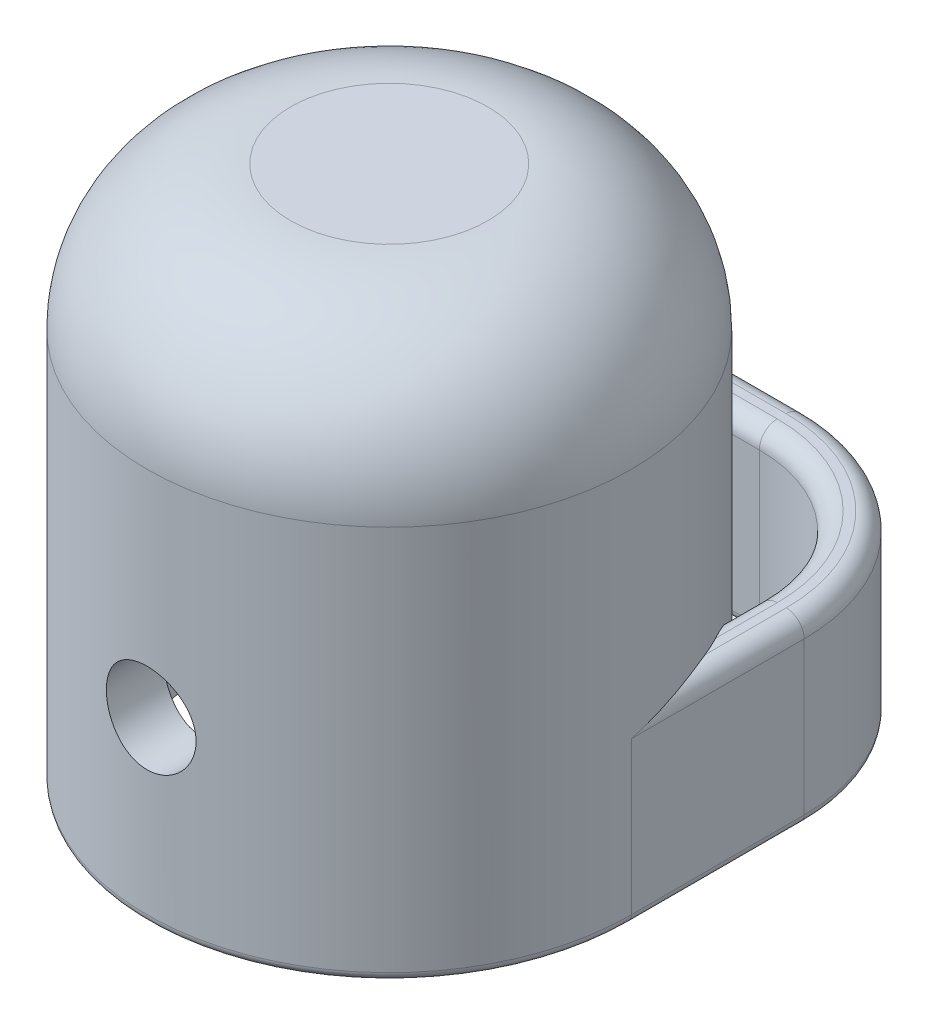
ISO-10303-21;
HEADER;
FILE_DESCRIPTION(('STEP AP214'),'2;1');
FILE_NAME('part.step','',(''),(''),'','','');
FILE_SCHEMA(('AUTOMOTIVE_DESIGN { 1 0 10303 214 1 1 1 1 }'));
ENDSEC;
DATA;
#1=APPLICATION_CONTEXT('core data for automotive mechanical design processes');
#2=APPLICATION_PROTOCOL_DEFINITION('international standard','automotive_design',2000,#1);
#3=PRODUCT_CONTEXT('',#1,'mechanical');
#4=PRODUCT('Part','Part','',(#3));
#5=PRODUCT_RELATED_PRODUCT_CATEGORY('part','',(#4));
#6=PRODUCT_DEFINITION_FORMATION('','',#4);
#7=PRODUCT_DEFINITION_CONTEXT('part definition',#1,'design');
#8=PRODUCT_DEFINITION('design','',#6,#7);
#9=PRODUCT_DEFINITION_SHAPE('','',#8);
#10=(LENGTH_UNIT() NAMED_UNIT(*) SI_UNIT(.MILLI.,.METRE.));
#11=(NAMED_UNIT(*) PLANE_ANGLE_UNIT() SI_UNIT($,.RADIAN.));
#12=(NAMED_UNIT(*) SI_UNIT($,.STERADIAN.) SOLID_ANGLE_UNIT());
#13=UNCERTAINTY_MEASURE_WITH_UNIT(LENGTH_MEASURE(1.E-05),#10,'distance_accuracy_value','');
#14=(GEOMETRIC_REPRESENTATION_CONTEXT(3) GLOBAL_UNCERTAINTY_ASSIGNED_CONTEXT((#13)) GLOBAL_UNIT_ASSIGNED_CONTEXT((#10,
#11,#12)) REPRESENTATION_CONTEXT('',''));
#15=CARTESIAN_POINT('',(0.,0.,0.));
#16=DIRECTION('',(0.,0.,1.));
#17=DIRECTION('',(1.,0.,0.));
#18=AXIS2_PLACEMENT_3D('',#15,#16,#17);
#19=CARTESIAN_POINT('',(0.,19.05,0.));
#20=DIRECTION('',(0.,-1.,0.));
#21=DIRECTION('',(0.,0.,-1.));
#22=AXIS2_PLACEMENT_3D('',#19,#20,#21);
#23=CYLINDRICAL_SURFACE('',#22,8.5725);
#24=CARTESIAN_POINT('',(0.,4.7625,8.5725));
#25=CARTESIAN_POINT('',(-0.088361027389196,4.76250339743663,8.57249840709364));
#26=CARTESIAN_POINT('',(-0.176766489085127,4.76990225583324,8.57111970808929));
#27=CARTESIAN_POINT('',(-0.351087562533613,4.79928393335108,8.56575267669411));
#28=CARTESIAN_POINT('',(-0.437000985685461,4.82127918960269,8.56176211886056));
#29=CARTESIAN_POINT('',(-0.603791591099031,4.87915820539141,8.55161790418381));
#30=CARTESIAN_POINT('',(-0.684673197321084,4.9150295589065,8.54546617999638));
#31=CARTESIAN_POINT('',(-0.839262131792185,4.99960760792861,8.53167193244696));
#32=CARTESIAN_POINT('',(-0.912970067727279,5.04831321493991,8.52402953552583));
#33=CARTESIAN_POINT('',(-1.05198915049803,5.15778199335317,8.50799797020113));
#34=CARTESIAN_POINT('',(-1.11720426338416,5.21866611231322,8.49960181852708));
#35=CARTESIAN_POINT('',(-1.2365558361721,5.35050344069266,8.4830610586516));
#36=CARTESIAN_POINT('',(-1.29069151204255,5.42145736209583,8.47491646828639));
#37=CARTESIAN_POINT('',(-1.38674524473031,5.57209666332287,8.45973314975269));
#38=CARTESIAN_POINT('',(-1.4285659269,5.6518451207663,8.45270342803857));
#39=CARTESIAN_POINT('',(-1.49817926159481,5.81738780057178,8.44064400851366));
#40=CARTESIAN_POINT('',(-1.52597309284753,5.90318151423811,8.4356141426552));
#41=CARTESIAN_POINT('',(-1.5664362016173,6.07735285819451,8.42819413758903));
#42=CARTESIAN_POINT('',(-1.57927276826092,6.1656903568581,8.42577482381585));
#43=CARTESIAN_POINT('',(-1.58997615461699,6.34329586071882,8.42376185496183));
#44=CARTESIAN_POINT('',(-1.58784428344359,6.43256378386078,8.42416795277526));
#45=CARTESIAN_POINT('',(-1.56880703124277,6.60828624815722,8.42773335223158));
#46=CARTESIAN_POINT('',(-1.5520916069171,6.69476219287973,8.4308572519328));
#47=CARTESIAN_POINT('',(-1.50466076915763,6.863660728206,8.43945068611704));
#48=CARTESIAN_POINT('',(-1.4739447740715,6.94608315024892,8.44492031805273));
#49=CARTESIAN_POINT('',(-1.39919814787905,7.10509227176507,8.45762607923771));
#50=CARTESIAN_POINT('',(-1.35509056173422,7.18164195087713,8.46487237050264));
#51=CARTESIAN_POINT('',(-1.25486725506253,7.32632519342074,8.48030821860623));
#52=CARTESIAN_POINT('',(-1.1987503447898,7.39445792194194,8.48849786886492));
#53=CARTESIAN_POINT('',(-1.07507591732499,7.52147098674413,8.50505207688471));
#54=CARTESIAN_POINT('',(-1.00735586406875,7.58019307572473,8.51341738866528));
#55=CARTESIAN_POINT('',(-0.862942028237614,7.68546683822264,8.52926464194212));
#56=CARTESIAN_POINT('',(-0.786248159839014,7.73201839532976,8.53674657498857));
#57=CARTESIAN_POINT('',(-0.625900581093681,7.81165193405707,8.54999860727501));
#58=CARTESIAN_POINT('',(-0.542238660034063,7.84471774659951,8.55576664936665));
#59=CARTESIAN_POINT('',(-0.370417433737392,7.89628272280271,8.56492503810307));
#60=CARTESIAN_POINT('',(-0.282258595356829,7.9147833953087,8.56831563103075));
#61=CARTESIAN_POINT('',(-0.105307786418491,7.93647333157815,8.5723033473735));
#62=CARTESIAN_POINT('',(-0.0165432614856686,7.93987946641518,8.57294003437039));
#63=CARTESIAN_POINT('',(0.160287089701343,7.93186496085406,8.57145738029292));
#64=CARTESIAN_POINT('',(0.248352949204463,7.92044503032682,8.56933817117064));
#65=CARTESIAN_POINT('',(0.420600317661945,7.88328288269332,8.56260646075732));
#66=CARTESIAN_POINT('',(0.504806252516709,7.85765012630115,8.55801302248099));
#67=CARTESIAN_POINT('',(0.667725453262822,7.79290819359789,8.54684577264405));
#68=CARTESIAN_POINT('',(0.746438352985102,7.75379811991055,8.54027182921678));
#69=CARTESIAN_POINT('',(0.897064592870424,7.66272980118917,8.52577410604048));
#70=CARTESIAN_POINT('',(0.968896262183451,7.61063869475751,8.51783664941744));
#71=CARTESIAN_POINT('',(1.10287646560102,7.49526711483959,8.50152828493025));
#72=CARTESIAN_POINT('',(1.16502411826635,7.43198562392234,8.49315733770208));
#73=CARTESIAN_POINT('',(1.27869387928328,7.29504881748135,8.47679458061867));
#74=CARTESIAN_POINT('',(1.33006815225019,7.22126990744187,8.46880907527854));
#75=CARTESIAN_POINT('',(1.41969423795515,7.06600190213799,8.4542471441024));
#76=CARTESIAN_POINT('',(1.45794653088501,6.98451308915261,8.44767066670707));
#77=CARTESIAN_POINT('',(1.52003186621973,6.81651818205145,8.4367206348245));
#78=CARTESIAN_POINT('',(1.54393334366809,6.7300380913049,8.43233664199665));
#79=CARTESIAN_POINT('',(1.57685016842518,6.5542009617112,8.42624382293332));
#80=CARTESIAN_POINT('',(1.58586714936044,6.46484423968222,8.42453470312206));
#81=CARTESIAN_POINT('',(1.58870540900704,6.28727061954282,8.42399977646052));
#82=CARTESIAN_POINT('',(1.58275981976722,6.19905749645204,8.42512973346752));
#83=CARTESIAN_POINT('',(1.55635138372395,6.02491114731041,8.43004768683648));
#84=CARTESIAN_POINT('',(1.53588861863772,5.93897790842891,8.43383566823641));
#85=CARTESIAN_POINT('',(1.48112402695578,5.77195196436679,8.44362444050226));
#86=CARTESIAN_POINT('',(1.44684684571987,5.69085093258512,8.4496212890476));
#87=CARTESIAN_POINT('',(1.36545172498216,5.53551351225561,8.46315499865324));
#88=CARTESIAN_POINT('',(1.31833290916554,5.46127759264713,8.47069196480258));
#89=CARTESIAN_POINT('',(1.21177902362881,5.32060868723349,8.48659434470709));
#90=CARTESIAN_POINT('',(1.15217406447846,5.25430555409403,8.49497025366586));
#91=CARTESIAN_POINT('',(1.02269464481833,5.13256429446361,8.51152765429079));
#92=CARTESIAN_POINT('',(0.952817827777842,5.07712866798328,8.51970910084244));
#93=CARTESIAN_POINT('',(0.804046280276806,4.97824392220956,8.53503961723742));
#94=CARTESIAN_POINT('',(0.725077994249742,4.93490392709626,8.54217902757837));
#95=CARTESIAN_POINT('',(0.560874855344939,4.86217507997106,8.55452680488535));
#96=CARTESIAN_POINT('',(0.475646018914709,4.83277303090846,8.55973699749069));
#97=CARTESIAN_POINT('',(0.325130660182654,4.79477301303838,8.56656826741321));
#98=CARTESIAN_POINT('',(0.260727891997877,4.78269116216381,8.56878018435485));
#99=CARTESIAN_POINT('',(0.130891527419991,4.76655349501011,8.57174662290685));
#100=CARTESIAN_POINT('',(0.065457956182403,4.76249748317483,8.57250118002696));
#101=CARTESIAN_POINT('',(0.,4.7625,8.5725));
#102=B_SPLINE_CURVE_WITH_KNOTS('',3,(#24,#25,#26,#27,#28,#29,#30,#31,#32,#33,#34,#35,#36,#37,
#38,#39,#40,#41,#42,#43,#44,#45,#46,#47,#48,#49,#50,#51,#52,#53,#54,#55,#56,#57,#58,#59,#60,#61,
#62,#63,#64,#65,#66,#67,#68,#69,#70,#71,#72,#73,#74,#75,#76,#77,#78,#79,#80,#81,#82,#83,#84,#85,
#86,#87,#88,#89,#90,#91,#92,#93,#94,#95,#96,#97,#98,#99,#100,#101),.UNSPECIFIED.,.T.,.F.,(4,2,2,
2,2,2,2,2,2,2,2,2,2,2,2,2,2,2,2,2,2,2,2,2,2,2,2,2,2,2,2,2,2,2,2,2,2,2,4),(0.,0.264843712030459,
0.529913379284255,0.794746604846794,1.05955737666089,1.32714177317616,1.59474509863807,
1.86441080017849,2.13405383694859,2.40065119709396,2.66722524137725,2.9303780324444,
3.19354175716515,3.45824733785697,3.7229791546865,3.99177855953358,4.26058053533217,
4.52970385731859,4.79879929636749,5.06401569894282,5.32921940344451,5.59240844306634,
5.85561501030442,6.12163490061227,6.38767898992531,6.65716426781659,6.92663968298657,
7.19481962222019,7.4629701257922,7.72696852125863,7.99096543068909,8.25449343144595,
8.51803941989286,8.78543597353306,9.05289396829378,9.32269217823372,9.59223441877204,
9.78843574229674,9.98463228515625),.UNSPECIFIED.);
#103=CARTESIAN_POINT('',(0.,4.7625,8.5725));
#104=VERTEX_POINT('',#103);
#105=EDGE_CURVE('E395',#104,#104,#102,.T.);
#106=ORIENTED_EDGE('',*,*,#105,.T.);
#107=EDGE_LOOP('',(#106));
#108=FACE_BOUND('',#107,.T.);
#109=CARTESIAN_POINT('',(0.,13.97,0.));
#110=DIRECTION('',(0.,1.,0.));
#111=DIRECTION('',(0.,0.,1.));
#112=AXIS2_PLACEMENT_3D('',#109,#110,#111);
#113=CIRCLE('',#112,8.5725);
#114=CARTESIAN_POINT('',(0.,13.97,8.5725));
#115=VERTEX_POINT('',#114);
#116=EDGE_CURVE('E486',#115,#115,#113,.F.);
#117=ORIENTED_EDGE('',*,*,#116,.T.);
#118=EDGE_LOOP('',(#117));
#119=FACE_BOUND('',#118,.T.);
#120=DIRECTION('',(0.,-1.,0.));
#121=VECTOR('',#120,1.);
#122=CARTESIAN_POINT('',(-8.5725,6.35,0.));
#123=LINE('',#122,#121);
#124=CARTESIAN_POINT('',(-8.5725,5.715,0.));
#125=VERTEX_POINT('',#124);
#126=CARTESIAN_POINT('',(-8.5725,0.317499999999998,0.));
#127=VERTEX_POINT('',#126);
#128=EDGE_CURVE('E451',#125,#127,#123,.T.);
#129=ORIENTED_EDGE('',*,*,#128,.T.);
#130=CARTESIAN_POINT('',(0.,0.317499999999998,0.));
#131=DIRECTION('',(0.,1.,0.));
#132=DIRECTION('',(0.,0.,1.));
#133=AXIS2_PLACEMENT_3D('',#130,#131,#132);
#134=CIRCLE('',#133,8.5725);
#135=CARTESIAN_POINT('',(8.5725,0.3175,0.));
#136=VERTEX_POINT('',#135);
#137=EDGE_CURVE('E351',#127,#136,#134,.T.);
#138=ORIENTED_EDGE('',*,*,#137,.T.);
#139=DIRECTION('',(0.,-1.,0.));
#140=VECTOR('',#139,1.);
#141=CARTESIAN_POINT('',(8.5725,6.35,0.));
#142=LINE('',#141,#140);
#143=CARTESIAN_POINT('',(8.5725,5.715,0.));
#144=VERTEX_POINT('',#143);
#145=EDGE_CURVE('E298',#144,#136,#142,.T.);
#146=ORIENTED_EDGE('',*,*,#145,.F.);
#147=CARTESIAN_POINT('',(7.9375,6.35,-3.23787739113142));
#148=CARTESIAN_POINT('',(7.95775083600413,6.34999370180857,-3.1882345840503));
#149=CARTESIAN_POINT('',(7.97753111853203,6.34903207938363,-3.13841128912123));
#150=CARTESIAN_POINT('',(8.01612969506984,6.34541230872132,-3.03846808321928));
#151=CARTESIAN_POINT('',(8.0349482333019,6.34275459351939,-2.98834825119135));
#152=CARTESIAN_POINT('',(8.08989663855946,6.33256649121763,-2.83773503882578));
#153=CARTESIAN_POINT('',(8.1245728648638,6.32281999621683,-2.73685654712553));
#154=CARTESIAN_POINT('',(8.18990373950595,6.29871696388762,-2.53465919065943));
#155=CARTESIAN_POINT('',(8.22056821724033,6.28437200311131,-2.43334205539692));
#156=CARTESIAN_POINT('',(8.27800142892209,6.25200085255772,-2.23015712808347));
#157=CARTESIAN_POINT('',(8.30476845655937,6.23397305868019,-2.12828911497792));
#158=CARTESIAN_POINT('',(8.37001671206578,6.18275849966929,-1.86005790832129));
#159=CARTESIAN_POINT('',(8.4052981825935,6.14716170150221,-1.69336624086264));
#160=CARTESIAN_POINT('',(8.46573486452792,6.07075845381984,-1.35938152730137));
#161=CARTESIAN_POINT('',(8.49088755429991,6.02995071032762,-1.19208834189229));
#162=CARTESIAN_POINT('',(8.55138360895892,5.90263058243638,-0.689520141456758));
#163=CARTESIAN_POINT('',(8.57178205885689,5.81120599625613,-0.353485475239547));
#164=CARTESIAN_POINT('',(8.57249378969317,5.71824190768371,-0.0119116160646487));
#165=CARTESIAN_POINT('',(8.57249999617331,5.71662092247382,-0.00595573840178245));
#166=CARTESIAN_POINT('',(8.5725,5.715,0.));
#167=B_SPLINE_CURVE_WITH_KNOTS('',3,(#147,#148,#149,#150,#151,#152,#153,#154,#155,#156,#157,
#158,#159,#160,#161,#162,#163,#164,#165,#166),.UNSPECIFIED.,.F.,.F.,(4,2,2,2,2,2,2,2,2,4),(0.,
0.160815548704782,0.321590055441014,0.642714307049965,0.963036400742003,1.28349831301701,
1.80520719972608,2.3270458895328,3.37050076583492,3.38901833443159),.UNSPECIFIED.);
#168=CARTESIAN_POINT('',(7.9375,6.35,-3.23787739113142));
#169=VERTEX_POINT('',#168);
#170=EDGE_CURVE('E220',#144,#169,#167,.F.);
#171=ORIENTED_EDGE('',*,*,#170,.T.);
#172=CARTESIAN_POINT('',(0.,6.35,0.));
#173=DIRECTION('',(0.,-1.,0.));
#174=DIRECTION('',(0.,0.,-1.));
#175=AXIS2_PLACEMENT_3D('',#172,#173,#174);
#176=CIRCLE('',#175,8.5725);
#177=CARTESIAN_POINT('',(7.62,6.35,-3.92725810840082));
#178=VERTEX_POINT('',#177);
#179=EDGE_CURVE('E202',#178,#169,#176,.T.);
#180=ORIENTED_EDGE('',*,*,#179,.F.);
#181=CARTESIAN_POINT('',(7.62,6.35,-3.92725810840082));
#182=CARTESIAN_POINT('',(7.59560719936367,6.34997991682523,-3.97459405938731));
#183=CARTESIAN_POINT('',(7.57075480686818,6.34859181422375,-4.02172492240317));
#184=CARTESIAN_POINT('',(7.52018057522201,6.34262973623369,-4.1155162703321));
#185=CARTESIAN_POINT('',(7.49445606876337,6.33804495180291,-4.16217461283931));
#186=CARTESIAN_POINT('',(7.44216436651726,6.32518692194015,-4.25497426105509));
#187=CARTESIAN_POINT('',(7.41559238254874,6.31688693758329,-4.3011092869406));
#188=CARTESIAN_POINT('',(7.36206697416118,6.29596602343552,-4.39209547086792));
#189=CARTESIAN_POINT('',(7.33511421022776,6.28335186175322,-4.43694852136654));
#190=CARTESIAN_POINT('',(7.28734067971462,6.2564175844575,-4.51486551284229));
#191=CARTESIAN_POINT('',(7.26652134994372,6.24314024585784,-4.54828795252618));
#192=CARTESIAN_POINT('',(7.22518179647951,6.21299415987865,-4.61367498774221));
#193=CARTESIAN_POINT('',(7.20466143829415,6.19612708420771,-4.64564025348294));
#194=CARTESIAN_POINT('',(7.16421664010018,6.15801937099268,-4.70777451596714));
#195=CARTESIAN_POINT('',(7.14429845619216,6.13674404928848,-4.73792665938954));
#196=CARTESIAN_POINT('',(7.10602933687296,6.08915099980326,-4.79513071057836));
#197=CARTESIAN_POINT('',(7.08767566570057,6.0628423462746,-4.8221880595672));
#198=CARTESIAN_POINT('',(7.05986316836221,6.01490300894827,-4.86276305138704));
#199=CARTESIAN_POINT('',(7.04956453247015,5.99494352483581,-4.8776707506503));
#200=CARTESIAN_POINT('',(7.03065970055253,5.95256992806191,-4.90488058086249));
#201=CARTESIAN_POINT('',(7.02205192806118,5.93015813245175,-4.91718513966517));
#202=CARTESIAN_POINT('',(7.00826966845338,5.88661310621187,-4.9368041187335));
#203=CARTESIAN_POINT('',(7.00277312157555,5.86579716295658,-4.94459134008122));
#204=CARTESIAN_POINT('',(6.99384951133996,5.82287780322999,-4.95720546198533));
#205=CARTESIAN_POINT('',(6.99041777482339,5.80077741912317,-4.96203904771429));
#206=CARTESIAN_POINT('',(6.98711856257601,5.76788959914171,-4.96668232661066));
#207=CARTESIAN_POINT('',(6.98632634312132,5.7573620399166,-4.96779646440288));
#208=CARTESIAN_POINT('',(6.98526651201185,5.73622502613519,-4.96928651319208));
#209=CARTESIAN_POINT('',(6.98499908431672,5.7256155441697,-4.9696621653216));
#210=CARTESIAN_POINT('',(6.98499999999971,5.71500000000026,-4.96966107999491));
#211=B_SPLINE_CURVE_WITH_KNOTS('',3,(#181,#182,#183,#184,#185,#186,#187,#188,#189,#190,#191,
#192,#193,#194,#195,#196,#197,#198,#199,#200,#201,#202,#203,#204,#205,#206,#207,#208,#209,#210),
.UNSPECIFIED.,.F.,.F.,(4,2,2,2,2,2,2,2,2,2,2,2,2,2,4),(0.,0.159777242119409,0.320097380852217,
0.48159040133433,0.642831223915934,0.767350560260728,0.891812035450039,1.01729273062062,
1.14254930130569,1.22319400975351,1.30376316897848,1.37217608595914,1.44043357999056,
1.47224749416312,1.50407255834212),.UNSPECIFIED.);
#212=CARTESIAN_POINT('',(6.985,5.715,-4.96966107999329));
#213=VERTEX_POINT('',#212);
#214=EDGE_CURVE('E216',#178,#213,#211,.T.);
#215=ORIENTED_EDGE('',*,*,#214,.T.);
#216=DIRECTION('',(0.,-1.,0.));
#217=VECTOR('',#216,1.);
#218=CARTESIAN_POINT('',(6.985,19.05,-4.96966107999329));
#219=LINE('',#218,#217);
#220=CARTESIAN_POINT('',(6.985,0.317500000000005,-4.96966107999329));
#221=VERTEX_POINT('',#220);
#222=EDGE_CURVE('E471',#221,#213,#219,.F.);
#223=ORIENTED_EDGE('',*,*,#222,.F.);
#224=CARTESIAN_POINT('',(0.,0.317499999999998,0.));
#225=DIRECTION('',(0.,1.,0.));
#226=DIRECTION('',(0.,0.,1.));
#227=AXIS2_PLACEMENT_3D('',#224,#225,#226);
#228=CIRCLE('',#227,8.5725);
#229=CARTESIAN_POINT('',(-6.985,0.317500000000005,-4.96966107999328));
#230=VERTEX_POINT('',#229);
#231=EDGE_CURVE('E349',#221,#230,#228,.T.);
#232=ORIENTED_EDGE('',*,*,#231,.T.);
#233=DIRECTION('',(0.,-1.,0.));
#234=VECTOR('',#233,1.);
#235=CARTESIAN_POINT('',(-6.985,19.05,-4.96966107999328));
#236=LINE('',#235,#234);
#237=CARTESIAN_POINT('',(-6.985,5.715,-4.96966107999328));
#238=VERTEX_POINT('',#237);
#239=EDGE_CURVE('E473',#238,#230,#236,.T.);
#240=ORIENTED_EDGE('',*,*,#239,.F.);
#241=CARTESIAN_POINT('',(-6.985,5.715,-4.96966107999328));
#242=CARTESIAN_POINT('',(-6.98499756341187,5.72768171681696,-4.96966406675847));
#243=CARTESIAN_POINT('',(-6.98538028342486,5.74035401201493,-4.96912661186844));
#244=CARTESIAN_POINT('',(-6.98689005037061,5.76555050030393,-4.9670037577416));
#245=CARTESIAN_POINT('',(-6.98801618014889,5.77807485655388,-4.96541964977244));
#246=CARTESIAN_POINT('',(-6.99243444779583,5.81496388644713,-4.95919783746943));
#247=CARTESIAN_POINT('',(-6.99676792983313,5.83897262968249,-4.9530887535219));
#248=CARTESIAN_POINT('',(-7.00775575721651,5.88513324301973,-4.93753010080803));
#249=CARTESIAN_POINT('',(-7.01439947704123,5.9072930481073,-4.92809582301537));
#250=CARTESIAN_POINT('',(-7.02951123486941,5.94963835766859,-4.90651636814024));
#251=CARTESIAN_POINT('',(-7.03798507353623,5.96981728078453,-4.89436256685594));
#252=CARTESIAN_POINT('',(-7.06112004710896,6.01820271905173,-4.86096045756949));
#253=CARTESIAN_POINT('',(-7.07668116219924,6.04500045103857,-4.8383046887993));
#254=CARTESIAN_POINT('',(-7.10966575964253,6.09402366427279,-4.78970580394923));
#255=CARTESIAN_POINT('',(-7.12709262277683,6.11624062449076,-4.76375670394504));
#256=CARTESIAN_POINT('',(-7.17500375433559,6.17024691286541,-4.69148078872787));
#257=CARTESIAN_POINT('',(-7.2064194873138,6.19848815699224,-4.64314117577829));
#258=CARTESIAN_POINT('',(-7.27013594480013,6.24642681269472,-4.54273756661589));
#259=CARTESIAN_POINT('',(-7.30244067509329,6.26607490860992,-4.49065402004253));
#260=CARTESIAN_POINT('',(-7.35951009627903,6.2947778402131,-4.39632631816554));
#261=CARTESIAN_POINT('',(-7.3843269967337,6.30522365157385,-4.3545222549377));
#262=CARTESIAN_POINT('',(-7.43356985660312,6.32257805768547,-4.26991731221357));
#263=CARTESIAN_POINT('',(-7.45799542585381,6.32948331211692,-4.22711553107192));
#264=CARTESIAN_POINT('',(-7.50576128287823,6.3401093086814,-4.14169628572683));
#265=CARTESIAN_POINT('',(-7.5291135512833,6.34389233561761,-4.09909297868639));
#266=CARTESIAN_POINT('',(-7.57510250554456,6.34882803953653,-4.01347025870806));
#267=CARTESIAN_POINT('',(-7.59774066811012,6.34998655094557,-3.97045198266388));
#268=CARTESIAN_POINT('',(-7.62,6.35,-3.92725810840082));
#269=B_SPLINE_CURVE_WITH_KNOTS('',3,(#241,#242,#243,#244,#245,#246,#247,#248,#249,#250,#251,
#252,#253,#254,#255,#256,#257,#258,#259,#260,#261,#262,#263,#264,#265,#266,#267,#268),
.UNSPECIFIED.,.F.,.F.,(4,2,2,2,2,2,2,2,2,2,2,2,2,4),(0.,0.0380105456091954,0.0759742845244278,
0.150935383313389,0.225556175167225,0.300417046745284,0.414926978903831,0.52964803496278,
0.721166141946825,0.913769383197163,1.06279408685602,1.21195912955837,1.35807121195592,
1.50385815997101),.UNSPECIFIED.);
#270=CARTESIAN_POINT('',(-7.62,6.35,-3.92725810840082));
#271=VERTEX_POINT('',#270);
#272=EDGE_CURVE('E227',#238,#271,#269,.T.);
#273=ORIENTED_EDGE('',*,*,#272,.T.);
#274=CARTESIAN_POINT('',(-7.9375,6.35,-3.23787739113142));
#275=VERTEX_POINT('',#274);
#276=EDGE_CURVE('E222',#275,#271,#176,.T.);
#277=ORIENTED_EDGE('',*,*,#276,.F.);
#278=CARTESIAN_POINT('',(-7.9375,6.35,-3.23787739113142));
#279=CARTESIAN_POINT('',(-7.95775083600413,6.34999370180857,-3.18823458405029));
#280=CARTESIAN_POINT('',(-7.97753111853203,6.34903207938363,-3.13841128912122));
#281=CARTESIAN_POINT('',(-8.01612969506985,6.34541230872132,-3.03846808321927));
#282=CARTESIAN_POINT('',(-8.0349482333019,6.34275459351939,-2.98834825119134));
#283=CARTESIAN_POINT('',(-8.08989663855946,6.33256649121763,-2.83773503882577));
#284=CARTESIAN_POINT('',(-8.12457286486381,6.32281999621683,-2.73685654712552));
#285=CARTESIAN_POINT('',(-8.18990373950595,6.29871696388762,-2.53465919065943));
#286=CARTESIAN_POINT('',(-8.22056821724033,6.28437200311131,-2.43334205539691));
#287=CARTESIAN_POINT('',(-8.27800142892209,6.25200085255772,-2.23015712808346));
#288=CARTESIAN_POINT('',(-8.30476845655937,6.23397305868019,-2.12828911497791));
#289=CARTESIAN_POINT('',(-8.37001671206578,6.18275849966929,-1.86005790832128));
#290=CARTESIAN_POINT('',(-8.4052981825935,6.14716170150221,-1.69336624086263));
#291=CARTESIAN_POINT('',(-8.46573486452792,6.07075845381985,-1.35938152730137));
#292=CARTESIAN_POINT('',(-8.49088755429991,6.02995071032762,-1.19208834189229));
#293=CARTESIAN_POINT('',(-8.55138360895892,5.90263058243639,-0.689520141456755));
#294=CARTESIAN_POINT('',(-8.57178205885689,5.81120599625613,-0.353485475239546));
#295=CARTESIAN_POINT('',(-8.57249378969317,5.71824190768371,-0.0119116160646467));
#296=CARTESIAN_POINT('',(-8.57249999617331,5.71662092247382,-0.00595573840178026));
#297=CARTESIAN_POINT('',(-8.5725,5.715,0.));
#298=B_SPLINE_CURVE_WITH_KNOTS('',3,(#278,#279,#280,#281,#282,#283,#284,#285,#286,#287,#288,
#289,#290,#291,#292,#293,#294,#295,#296,#297),.UNSPECIFIED.,.F.,.F.,(4,2,2,2,2,2,2,2,2,4),(0.,
0.160815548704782,0.321590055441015,0.642714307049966,0.963036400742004,1.28349831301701,
1.80520719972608,2.32704588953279,3.37050076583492,3.38901833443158),.UNSPECIFIED.);
#299=EDGE_CURVE('E226',#275,#125,#298,.T.);
#300=ORIENTED_EDGE('',*,*,#299,.T.);
#301=EDGE_LOOP('',(#129,#138,#146,#171,#180,#215,#223,#232,#240,#273,#277,#300));
#302=FACE_BOUND('',#301,.T.);
#303=ADVANCED_FACE('F33',(#108,#119,#302),#23,.T.);
#304=CARTESIAN_POINT('',(0.,19.05,0.));
#305=DIRECTION('',(0.,1.,0.));
#306=DIRECTION('',(0.,0.,1.));
#307=AXIS2_PLACEMENT_3D('',#304,#305,#306);
#308=PLANE('',#307);
#309=CARTESIAN_POINT('',(0.,19.05,0.));
#310=DIRECTION('',(0.,1.,0.));
#311=DIRECTION('',(0.,0.,1.));
#312=AXIS2_PLACEMENT_3D('',#309,#310,#311);
#313=CIRCLE('',#312,3.4925);
#314=CARTESIAN_POINT('',(0.,19.05,3.4925));
#315=VERTEX_POINT('',#314);
#316=EDGE_CURVE('E481',#315,#315,#313,.T.);
#317=ORIENTED_EDGE('',*,*,#316,.T.);
#318=EDGE_LOOP('',(#317));
#319=FACE_BOUND('',#318,.T.);
#320=ADVANCED_FACE('F590',(#319),#308,.T.);
#321=CARTESIAN_POINT('',(0.,0.,0.));
#322=DIRECTION('',(0.,1.,0.));
#323=DIRECTION('',(0.,0.,1.));
#324=AXIS2_PLACEMENT_3D('',#321,#322,#323);
#325=PLANE('',#324);
#326=DIRECTION('',(0.,0.,-1.));
#327=VECTOR('',#326,1.);
#328=CARTESIAN_POINT('',(-7.3025,0.,0.));
#329=LINE('',#328,#327);
#330=CARTESIAN_POINT('',(-7.3025,0.,-6.1125));
#331=VERTEX_POINT('',#330);
#332=CARTESIAN_POINT('',(-7.3025,0.,-3.84948291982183));
#333=VERTEX_POINT('',#332);
#334=EDGE_CURVE('E333',#331,#333,#329,.F.);
#335=ORIENTED_EDGE('',*,*,#334,.T.);
#336=CARTESIAN_POINT('',(0.,0.,0.));
#337=DIRECTION('',(0.,1.,0.));
#338=DIRECTION('',(0.,0.,1.));
#339=AXIS2_PLACEMENT_3D('',#336,#337,#338);
#340=CIRCLE('',#339,8.255);
#341=CARTESIAN_POINT('',(7.3025,0.,-3.84948291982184));
#342=VERTEX_POINT('',#341);
#343=EDGE_CURVE('E336',#333,#342,#340,.F.);
#344=ORIENTED_EDGE('',*,*,#343,.T.);
#345=DIRECTION('',(0.,0.,1.));
#346=VECTOR('',#345,1.);
#347=CARTESIAN_POINT('',(7.3025,0.,0.));
#348=LINE('',#347,#346);
#349=CARTESIAN_POINT('',(7.3025,0.,-6.1125));
#350=VERTEX_POINT('',#349);
#351=EDGE_CURVE('E329',#342,#350,#348,.F.);
#352=ORIENTED_EDGE('',*,*,#351,.T.);
#353=CARTESIAN_POINT('',(1.985,0.,-6.1125));
#354=DIRECTION('',(0.,1.,0.));
#355=DIRECTION('',(0.,0.,1.));
#356=AXIS2_PLACEMENT_3D('',#353,#354,#355);
#357=CIRCLE('',#356,5.3175);
#358=CARTESIAN_POINT('',(1.985,0.,-11.43));
#359=VERTEX_POINT('',#358);
#360=EDGE_CURVE('E327',#350,#359,#357,.T.);
#361=ORIENTED_EDGE('',*,*,#360,.T.);
#362=DIRECTION('',(1.,0.,0.));
#363=VECTOR('',#362,1.);
#364=CARTESIAN_POINT('',(0.,0.,-11.43));
#365=LINE('',#364,#363);
#366=CARTESIAN_POINT('',(-1.985,0.,-11.43));
#367=VERTEX_POINT('',#366);
#368=EDGE_CURVE('E325',#359,#367,#365,.F.);
#369=ORIENTED_EDGE('',*,*,#368,.T.);
#370=CARTESIAN_POINT('',(-1.985,0.,-6.1125));
#371=DIRECTION('',(0.,1.,0.));
#372=DIRECTION('',(0.,0.,1.));
#373=AXIS2_PLACEMENT_3D('',#370,#371,#372);
#374=CIRCLE('',#373,5.3175);
#375=EDGE_CURVE('E331',#367,#331,#374,.T.);
#376=ORIENTED_EDGE('',*,*,#375,.T.);
#377=EDGE_LOOP('',(#335,#344,#352,#361,#369,#376));
#378=FACE_BOUND('',#377,.T.);
#379=DIRECTION('',(0.,0.,-1.));
#380=VECTOR('',#379,1.);
#381=CARTESIAN_POINT('',(-8.255,0.,-6.1125));
#382=LINE('',#381,#380);
#383=CARTESIAN_POINT('',(-8.255,0.,0.));
#384=VERTEX_POINT('',#383);
#385=CARTESIAN_POINT('',(-8.255,0.,-6.1125));
#386=VERTEX_POINT('',#385);
#387=EDGE_CURVE('E320',#384,#386,#382,.T.);
#388=ORIENTED_EDGE('',*,*,#387,.T.);
#389=CARTESIAN_POINT('',(-1.985,0.,-6.1125));
#390=DIRECTION('',(0.,1.,0.));
#391=DIRECTION('',(0.,0.,1.));
#392=AXIS2_PLACEMENT_3D('',#389,#390,#391);
#393=CIRCLE('',#392,6.27);
#394=CARTESIAN_POINT('',(-1.985,0.,-12.3825));
#395=VERTEX_POINT('',#394);
#396=EDGE_CURVE('E322',#386,#395,#393,.F.);
#397=ORIENTED_EDGE('',*,*,#396,.T.);
#398=DIRECTION('',(1.,0.,0.));
#399=VECTOR('',#398,1.);
#400=CARTESIAN_POINT('',(1.985,0.,-12.3825));
#401=LINE('',#400,#399);
#402=CARTESIAN_POINT('',(1.985,0.,-12.3825));
#403=VERTEX_POINT('',#402);
#404=EDGE_CURVE('E312',#395,#403,#401,.T.);
#405=ORIENTED_EDGE('',*,*,#404,.T.);
#406=CARTESIAN_POINT('',(1.985,0.,-6.1125));
#407=DIRECTION('',(0.,1.,0.));
#408=DIRECTION('',(0.,0.,1.));
#409=AXIS2_PLACEMENT_3D('',#406,#407,#408);
#410=CIRCLE('',#409,6.27);
#411=CARTESIAN_POINT('',(8.255,0.,-6.1125));
#412=VERTEX_POINT('',#411);
#413=EDGE_CURVE('E314',#403,#412,#410,.F.);
#414=ORIENTED_EDGE('',*,*,#413,.T.);
#415=DIRECTION('',(0.,0.,1.));
#416=VECTOR('',#415,1.);
#417=CARTESIAN_POINT('',(8.255,0.,0.));
#418=LINE('',#417,#416);
#419=CARTESIAN_POINT('',(8.255,0.,0.));
#420=VERTEX_POINT('',#419);
#421=EDGE_CURVE('E316',#412,#420,#418,.T.);
#422=ORIENTED_EDGE('',*,*,#421,.T.);
#423=CARTESIAN_POINT('',(0.,0.,0.));
#424=DIRECTION('',(0.,1.,0.));
#425=DIRECTION('',(0.,0.,1.));
#426=AXIS2_PLACEMENT_3D('',#423,#424,#425);
#427=CIRCLE('',#426,8.255);
#428=EDGE_CURVE('E318',#420,#384,#427,.F.);
#429=ORIENTED_EDGE('',*,*,#428,.T.);
#430=EDGE_LOOP('',(#388,#397,#405,#414,#422,#429));
#431=FACE_BOUND('',#430,.T.);
#432=CARTESIAN_POINT('',(0.,0.,0.));
#433=DIRECTION('',(0.,-1.,0.));
#434=DIRECTION('',(0.,0.,-1.));
#435=AXIS2_PLACEMENT_3D('',#432,#433,#434);
#436=CIRCLE('',#435,6.604);
#437=CARTESIAN_POINT('',(0.,0.,-6.604));
#438=VERTEX_POINT('',#437);
#439=EDGE_CURVE('E477',#438,#438,#436,.T.);
#440=ORIENTED_EDGE('',*,*,#439,.F.);
#441=EDGE_LOOP('',(#440));
#442=FACE_BOUND('',#441,.T.);
#443=ADVANCED_FACE('F586',(#378,#431,#442),#325,.F.);
#444=CARTESIAN_POINT('',(0.,12.7,0.));
#445=DIRECTION('',(0.,-1.,0.));
#446=DIRECTION('',(0.,0.,-1.));
#447=AXIS2_PLACEMENT_3D('',#444,#445,#446);
#448=CYLINDRICAL_SURFACE('',#447,6.604);
#449=CARTESIAN_POINT('',(0.,4.7625,6.604));
#450=CARTESIAN_POINT('',(0.0878183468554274,4.76250265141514,6.60399845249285));
#451=CARTESIAN_POINT('',(0.175667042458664,4.76981153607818,6.60223075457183));
#452=CARTESIAN_POINT('',(0.348853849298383,4.79881450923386,6.59535015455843));
#453=CARTESIAN_POINT('',(0.434190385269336,4.82051743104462,6.59023519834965));
#454=CARTESIAN_POINT('',(0.599826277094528,4.87757741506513,6.57722748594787));
#455=CARTESIAN_POINT('',(0.680131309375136,4.9129187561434,6.56933792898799));
#456=CARTESIAN_POINT('',(0.833671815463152,4.99619874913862,6.55162484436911));
#457=CARTESIAN_POINT('',(0.90690718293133,5.04413759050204,6.54180128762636));
#458=CARTESIAN_POINT('',(1.04563263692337,5.15222196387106,6.52107947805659));
#459=CARTESIAN_POINT('',(1.11096803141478,5.21256307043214,6.51016566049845));
#460=CARTESIAN_POINT('',(1.23069541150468,5.34332002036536,6.48859875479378));
#461=CARTESIAN_POINT('',(1.28508624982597,5.41373691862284,6.47794569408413));
#462=CARTESIAN_POINT('',(1.38209357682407,5.56382928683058,6.45795073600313));
#463=CARTESIAN_POINT('',(1.4245397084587,5.64361774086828,6.4486286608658));
#464=CARTESIAN_POINT('',(1.49535810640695,5.80945734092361,6.4325770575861));
#465=CARTESIAN_POINT('',(1.52373243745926,5.89550756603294,6.42584714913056));
#466=CARTESIAN_POINT('',(1.56507932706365,6.06973415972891,6.41590140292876));
#467=CARTESIAN_POINT('',(1.57832869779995,6.15784115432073,6.41262249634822));
#468=CARTESIAN_POINT('',(1.58991132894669,6.33508365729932,6.40976102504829));
#469=CARTESIAN_POINT('',(1.588246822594,6.42421900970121,6.41017790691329));
#470=CARTESIAN_POINT('',(1.57027041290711,6.59888727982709,6.41460408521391));
#471=CARTESIAN_POINT('',(1.55428565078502,6.68445621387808,6.41853314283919));
#472=CARTESIAN_POINT('',(1.50864319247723,6.85166094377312,6.42941342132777));
#473=CARTESIAN_POINT('',(1.478984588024,6.93329647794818,6.43636484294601));
#474=CARTESIAN_POINT('',(1.40655071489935,7.09120784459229,6.45258197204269));
#475=CARTESIAN_POINT('',(1.36365447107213,7.16742591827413,6.46186887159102));
#476=CARTESIAN_POINT('',(1.26604772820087,7.31170064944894,6.48169826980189));
#477=CARTESIAN_POINT('',(1.21133530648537,7.37975597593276,6.49224097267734));
#478=CARTESIAN_POINT('',(1.08994278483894,7.50765100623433,6.51373401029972));
#479=CARTESIAN_POINT('',(1.02298591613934,7.56722774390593,6.52468777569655));
#480=CARTESIAN_POINT('',(0.879902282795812,7.67435473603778,6.54551805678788));
#481=CARTESIAN_POINT('',(0.803775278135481,7.72190467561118,6.55539454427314));
#482=CARTESIAN_POINT('',(0.644154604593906,7.80371456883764,6.57300075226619));
#483=CARTESIAN_POINT('',(0.560639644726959,7.83793446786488,6.58072398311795));
#484=CARTESIAN_POINT('',(0.38881638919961,7.8917780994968,6.59310603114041));
#485=CARTESIAN_POINT('',(0.300508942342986,7.91140440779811,6.59776538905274));
#486=CARTESIAN_POINT('',(0.123858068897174,7.93510829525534,6.60341566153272));
#487=CARTESIAN_POINT('',(0.0355653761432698,7.9395443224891,6.60449112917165));
#488=CARTESIAN_POINT('',(-0.14050021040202,7.93372113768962,6.60309202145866));
#489=CARTESIAN_POINT('',(-0.228273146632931,7.92346314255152,6.60061774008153));
#490=CARTESIAN_POINT('',(-0.399580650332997,7.88883921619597,6.59245107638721));
#491=CARTESIAN_POINT('',(-0.4831565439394,7.86466642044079,6.5868027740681));
#492=CARTESIAN_POINT('',(-0.645064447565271,7.80311766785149,6.57292296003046));
#493=CARTESIAN_POINT('',(-0.723395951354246,7.76574043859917,6.5646911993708));
#494=CARTESIAN_POINT('',(-0.874035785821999,7.67813254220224,6.54635290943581));
#495=CARTESIAN_POINT('',(-0.946221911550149,7.62769795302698,6.53621740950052));
#496=CARTESIAN_POINT('',(-1.081234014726,7.51567010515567,6.51524559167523));
#497=CARTESIAN_POINT('',(-1.14405850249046,7.45407507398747,6.50440916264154));
#498=CARTESIAN_POINT('',(-1.26002223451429,7.31981611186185,6.482956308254));
#499=CARTESIAN_POINT('',(-1.31291097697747,7.24693379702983,6.47235036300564));
#500=CARTESIAN_POINT('',(-1.40570393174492,7.09311436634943,6.45283423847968));
#501=CARTESIAN_POINT('',(-1.44560872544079,7.01217761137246,6.44392398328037));
#502=CARTESIAN_POINT('',(-1.51100988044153,6.84498777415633,6.42890283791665));
#503=CARTESIAN_POINT('',(-1.53659126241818,6.75876950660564,6.42277547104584));
#504=CARTESIAN_POINT('',(-1.57285305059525,6.58308800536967,6.41399281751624));
#505=CARTESIAN_POINT('',(-1.5835364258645,6.49362542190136,6.41133683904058));
#506=CARTESIAN_POINT('',(-1.58955276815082,6.31653596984,6.40984754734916));
#507=CARTESIAN_POINT('',(-1.58528499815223,6.2289232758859,6.41091480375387));
#508=CARTESIAN_POINT('',(-1.56242717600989,6.05570572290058,6.41652344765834));
#509=CARTESIAN_POINT('',(-1.54383737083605,5.97010082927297,6.42106477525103));
#510=CARTESIAN_POINT('',(-1.49307347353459,5.80372548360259,6.43305661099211));
#511=CARTESIAN_POINT('',(-1.46096890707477,5.72293267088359,6.44049221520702));
#512=CARTESIAN_POINT('',(-1.38414284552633,5.56782493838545,6.45743797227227));
#513=CARTESIAN_POINT('',(-1.33941973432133,5.49351084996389,6.46694839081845));
#514=CARTESIAN_POINT('',(-1.2373512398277,5.35152804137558,6.48726005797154));
#515=CARTESIAN_POINT('',(-1.17972636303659,5.28406388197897,6.49808699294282));
#516=CARTESIAN_POINT('',(-1.05404187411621,5.15963284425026,6.51965257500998));
#517=CARTESIAN_POINT('',(-0.985979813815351,5.1026684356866,6.53039120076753));
#518=CARTESIAN_POINT('',(-0.840006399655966,4.9999479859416,6.55077998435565));
#519=CARTESIAN_POINT('',(-0.761951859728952,4.95439102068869,6.5604094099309));
#520=CARTESIAN_POINT('',(-0.599070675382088,4.87711762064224,6.57727994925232));
#521=CARTESIAN_POINT('',(-0.514249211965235,4.84539071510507,6.58452286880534));
#522=CARTESIAN_POINT('',(-0.357914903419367,4.80169509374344,6.59466139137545));
#523=CARTESIAN_POINT('',(-0.287181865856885,4.78702746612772,6.59814009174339));
#524=CARTESIAN_POINT('',(-0.144305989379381,4.7674291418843,6.60280995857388));
#525=CARTESIAN_POINT('',(-0.0721632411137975,4.76249782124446,6.60400127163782));
#526=CARTESIAN_POINT('',(0.,4.7625,6.604));
#527=B_SPLINE_CURVE_WITH_KNOTS('',3,(#449,#450,#451,#452,#453,#454,#455,#456,#457,#458,#459,
#460,#461,#462,#463,#464,#465,#466,#467,#468,#469,#470,#471,#472,#473,#474,#475,#476,#477,#478,
#479,#480,#481,#482,#483,#484,#485,#486,#487,#488,#489,#490,#491,#492,#493,#494,#495,#496,#497,
#498,#499,#500,#501,#502,#503,#504,#505,#506,#507,#508,#509,#510,#511,#512,#513,#514,#515,#516,
#517,#518,#519,#520,#521,#522,#523,#524,#525,#526),.UNSPECIFIED.,.T.,.F.,(4,2,2,2,2,2,2,2,2,2,2,
2,2,2,2,2,2,2,2,2,2,2,2,2,2,2,2,2,2,2,2,2,2,2,2,2,2,2,4),(0.,0.263190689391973,
0.526543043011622,0.789592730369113,1.05264637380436,1.32021959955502,1.58782085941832,
1.85906484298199,2.13026901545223,2.39642584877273,2.6625428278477,2.92273124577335,
3.18293694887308,3.44559478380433,3.70829538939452,3.97790105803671,4.24751378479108,
4.51793051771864,4.78829951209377,5.05224287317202,5.31616437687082,5.57650810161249,
5.83687692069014,6.1015870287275,6.36633921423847,6.63706480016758,6.90777826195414,
7.17686731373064,7.44590273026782,7.70780908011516,7.96971091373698,8.23028156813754,
8.49088561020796,8.75780190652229,9.02478090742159,9.29613708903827,9.56728746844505,
9.7835738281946,9.99984632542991),.UNSPECIFIED.);
#528=CARTESIAN_POINT('',(0.,4.7625,6.604));
#529=VERTEX_POINT('',#528);
#530=EDGE_CURVE('E889',#529,#529,#527,.T.);
#531=ORIENTED_EDGE('',*,*,#530,.T.);
#532=EDGE_LOOP('',(#531));
#533=FACE_BOUND('',#532,.T.);
#534=CARTESIAN_POINT('',(0.,12.7,0.));
#535=DIRECTION('',(0.,-1.,0.));
#536=DIRECTION('',(0.,0.,-1.));
#537=AXIS2_PLACEMENT_3D('',#534,#535,#536);
#538=CIRCLE('',#537,6.604);
#539=CARTESIAN_POINT('',(0.,12.7,-6.604));
#540=VERTEX_POINT('',#539);
#541=EDGE_CURVE('E478',#540,#540,#538,.T.);
#542=ORIENTED_EDGE('',*,*,#541,.F.);
#543=EDGE_LOOP('',(#542));
#544=FACE_BOUND('',#543,.T.);
#545=ORIENTED_EDGE('',*,*,#439,.T.);
#546=EDGE_LOOP('',(#545));
#547=FACE_BOUND('',#546,.T.);
#548=ADVANCED_FACE('F589',(#533,#544,#547),#448,.F.);
#549=CARTESIAN_POINT('',(0.,12.7,0.));
#550=DIRECTION('',(0.,-1.,0.));
#551=DIRECTION('',(0.,0.,-1.));
#552=AXIS2_PLACEMENT_3D('',#549,#550,#551);
#553=PLANE('',#552);
#554=ORIENTED_EDGE('',*,*,#541,.T.);
#555=EDGE_LOOP('',(#554));
#556=FACE_BOUND('',#555,.T.);
#557=ADVANCED_FACE('F595',(#556),#553,.T.);
#558=CARTESIAN_POINT('',(0.,13.97,0.));
#559=DIRECTION('',(0.,1.,0.));
#560=DIRECTION('',(0.,0.,1.));
#561=AXIS2_PLACEMENT_3D('',#558,#559,#560);
#562=DEGENERATE_TOROIDAL_SURFACE('',#561,3.4925,5.08,.T.);
#563=ORIENTED_EDGE('',*,*,#116,.F.);
#564=EDGE_LOOP('',(#563));
#565=FACE_BOUND('',#564,.T.);
#566=ORIENTED_EDGE('',*,*,#316,.F.);
#567=EDGE_LOOP('',(#566));
#568=FACE_BOUND('',#567,.T.);
#569=ADVANCED_FACE('F603',(#565,#568),#562,.T.);
#570=CARTESIAN_POINT('',(-6.985,6.35,0.));
#571=DIRECTION('',(-1.,0.,0.));
#572=DIRECTION('',(0.,0.,1.));
#573=AXIS2_PLACEMENT_3D('',#570,#571,#572);
#574=PLANE('',#573);
#575=ORIENTED_EDGE('',*,*,#239,.T.);
#576=DIRECTION('',(0.,0.,-1.));
#577=VECTOR('',#576,1.);
#578=CARTESIAN_POINT('',(-6.985,0.3175,0.));
#579=LINE('',#578,#577);
#580=CARTESIAN_POINT('',(-6.985,0.3175,-6.1125));
#581=VERTEX_POINT('',#580);
#582=EDGE_CURVE('E286',#230,#581,#579,.T.);
#583=ORIENTED_EDGE('',*,*,#582,.T.);
#584=DIRECTION('',(0.,-1.,0.));
#585=VECTOR('',#584,1.);
#586=CARTESIAN_POINT('',(-6.985,6.35,-6.1125));
#587=LINE('',#586,#585);
#588=CARTESIAN_POINT('',(-6.985,5.715,-6.1125));
#589=VERTEX_POINT('',#588);
#590=EDGE_CURVE('E455',#589,#581,#587,.T.);
#591=ORIENTED_EDGE('',*,*,#590,.F.);
#592=DIRECTION('',(0.,0.,-1.));
#593=VECTOR('',#592,1.);
#594=CARTESIAN_POINT('',(-6.985,5.715,0.));
#595=LINE('',#594,#593);
#596=EDGE_CURVE('E505',#589,#238,#595,.F.);
#597=ORIENTED_EDGE('',*,*,#596,.T.);
#598=EDGE_LOOP('',(#575,#583,#591,#597));
#599=FACE_BOUND('',#598,.T.);
#600=ADVANCED_FACE('F554',(#599),#574,.F.);
#601=CARTESIAN_POINT('',(6.985,6.35,-6.1125));
#602=DIRECTION('',(1.,0.,0.));
#603=DIRECTION('',(0.,0.,-1.));
#604=AXIS2_PLACEMENT_3D('',#601,#602,#603);
#605=PLANE('',#604);
#606=DIRECTION('',(0.,-1.,0.));
#607=VECTOR('',#606,1.);
#608=CARTESIAN_POINT('',(6.985,6.35,-6.1125));
#609=LINE('',#608,#607);
#610=CARTESIAN_POINT('',(6.985,5.715,-6.1125));
#611=VERTEX_POINT('',#610);
#612=CARTESIAN_POINT('',(6.985,0.3175,-6.1125));
#613=VERTEX_POINT('',#612);
#614=EDGE_CURVE('E467',#611,#613,#609,.T.);
#615=ORIENTED_EDGE('',*,*,#614,.T.);
#616=DIRECTION('',(0.,0.,1.));
#617=VECTOR('',#616,1.);
#618=CARTESIAN_POINT('',(6.985,0.3175,-6.1125));
#619=LINE('',#618,#617);
#620=EDGE_CURVE('E340',#613,#221,#619,.T.);
#621=ORIENTED_EDGE('',*,*,#620,.T.);
#622=ORIENTED_EDGE('',*,*,#222,.T.);
#623=DIRECTION('',(0.,0.,1.));
#624=VECTOR('',#623,1.);
#625=CARTESIAN_POINT('',(6.985,5.715,-6.1125));
#626=LINE('',#625,#624);
#627=EDGE_CURVE('E225',#213,#611,#626,.F.);
#628=ORIENTED_EDGE('',*,*,#627,.T.);
#629=EDGE_LOOP('',(#615,#621,#622,#628));
#630=FACE_BOUND('',#629,.T.);
#631=ADVANCED_FACE('F580',(#630),#605,.F.);
#632=CARTESIAN_POINT('',(8.5725,6.35,-6.1125));
#633=DIRECTION('',(1.,0.,0.));
#634=DIRECTION('',(0.,0.,-1.));
#635=AXIS2_PLACEMENT_3D('',#632,#633,#634);
#636=PLANE('',#635);
#637=ORIENTED_EDGE('',*,*,#145,.T.);
#638=DIRECTION('',(0.,0.,1.));
#639=VECTOR('',#638,1.);
#640=CARTESIAN_POINT('',(8.5725,0.3175,-6.1125));
#641=LINE('',#640,#639);
#642=CARTESIAN_POINT('',(8.5725,0.3175,-6.1125));
#643=VERTEX_POINT('',#642);
#644=EDGE_CURVE('E58',#136,#643,#641,.F.);
#645=ORIENTED_EDGE('',*,*,#644,.T.);
#646=DIRECTION('',(0.,-1.,0.));
#647=VECTOR('',#646,1.);
#648=CARTESIAN_POINT('',(8.5725,6.35,-6.1125));
#649=LINE('',#648,#647);
#650=CARTESIAN_POINT('',(8.5725,5.715,-6.1125));
#651=VERTEX_POINT('',#650);
#652=EDGE_CURVE('E474',#651,#643,#649,.T.);
#653=ORIENTED_EDGE('',*,*,#652,.F.);
#654=DIRECTION('',(0.,0.,1.));
#655=VECTOR('',#654,1.);
#656=CARTESIAN_POINT('',(8.5725,5.715,0.));
#657=LINE('',#656,#655);
#658=EDGE_CURVE('E517',#651,#144,#657,.T.);
#659=ORIENTED_EDGE('',*,*,#658,.T.);
#660=EDGE_LOOP('',(#637,#645,#653,#659));
#661=FACE_BOUND('',#660,.T.);
#662=ADVANCED_FACE('F524',(#661),#636,.T.);
#663=CARTESIAN_POINT('',(1.985,6.35,-6.1125));
#664=DIRECTION('',(0.,-1.,0.));
#665=DIRECTION('',(0.,0.,-1.));
#666=AXIS2_PLACEMENT_3D('',#663,#664,#665);
#667=CYLINDRICAL_SURFACE('',#666,6.5875);
#668=ORIENTED_EDGE('',*,*,#652,.T.);
#669=CARTESIAN_POINT('',(1.985,0.3175,-6.1125));
#670=DIRECTION('',(0.,1.,0.));
#671=DIRECTION('',(0.,0.,1.));
#672=AXIS2_PLACEMENT_3D('',#669,#670,#671);
#673=CIRCLE('',#672,6.5875);
#674=CARTESIAN_POINT('',(1.985,0.3175,-12.7));
#675=VERTEX_POINT('',#674);
#676=EDGE_CURVE('E50',#643,#675,#673,.T.);
#677=ORIENTED_EDGE('',*,*,#676,.T.);
#678=DIRECTION('',(0.,-1.,0.));
#679=VECTOR('',#678,1.);
#680=CARTESIAN_POINT('',(1.985,6.35,-12.7));
#681=LINE('',#680,#679);
#682=CARTESIAN_POINT('',(1.985,5.715,-12.7));
#683=VERTEX_POINT('',#682);
#684=EDGE_CURVE('E429',#683,#675,#681,.T.);
#685=ORIENTED_EDGE('',*,*,#684,.F.);
#686=CARTESIAN_POINT('',(1.985,5.715,-6.1125));
#687=DIRECTION('',(0.,-1.,0.));
#688=DIRECTION('',(0.,0.,-1.));
#689=AXIS2_PLACEMENT_3D('',#686,#687,#688);
#690=CIRCLE('',#689,6.5875);
#691=EDGE_CURVE('E230',#683,#651,#690,.T.);
#692=ORIENTED_EDGE('',*,*,#691,.T.);
#693=EDGE_LOOP('',(#668,#677,#685,#692));
#694=FACE_BOUND('',#693,.T.);
#695=ADVANCED_FACE('F521',(#694),#667,.T.);
#696=CARTESIAN_POINT('',(-1.985,6.35,-12.7));
#697=DIRECTION('',(0.,0.,-1.));
#698=DIRECTION('',(-1.,0.,0.));
#699=AXIS2_PLACEMENT_3D('',#696,#697,#698);
#700=PLANE('',#699);
#701=ORIENTED_EDGE('',*,*,#684,.T.);
#702=DIRECTION('',(1.,0.,0.));
#703=VECTOR('',#702,1.);
#704=CARTESIAN_POINT('',(-1.985,0.3175,-12.7));
#705=LINE('',#704,#703);
#706=CARTESIAN_POINT('',(-1.985,0.3175,-12.7));
#707=VERTEX_POINT('',#706);
#708=EDGE_CURVE('E11',#675,#707,#705,.F.);
#709=ORIENTED_EDGE('',*,*,#708,.T.);
#710=DIRECTION('',(0.,-1.,0.));
#711=VECTOR('',#710,1.);
#712=CARTESIAN_POINT('',(-1.985,6.35,-12.7));
#713=LINE('',#712,#711);
#714=CARTESIAN_POINT('',(-1.985,5.715,-12.7));
#715=VERTEX_POINT('',#714);
#716=EDGE_CURVE('E427',#715,#707,#713,.T.);
#717=ORIENTED_EDGE('',*,*,#716,.F.);
#718=DIRECTION('',(1.,0.,0.));
#719=VECTOR('',#718,1.);
#720=CARTESIAN_POINT('',(1.985,5.715,-12.7));
#721=LINE('',#720,#719);
#722=EDGE_CURVE('E515',#715,#683,#721,.T.);
#723=ORIENTED_EDGE('',*,*,#722,.T.);
#724=EDGE_LOOP('',(#701,#709,#717,#723));
#725=FACE_BOUND('',#724,.T.);
#726=ADVANCED_FACE('F426',(#725),#700,.T.);
#727=CARTESIAN_POINT('',(-1.985,6.35,-6.1125));
#728=DIRECTION('',(0.,-1.,0.));
#729=DIRECTION('',(0.,0.,-1.));
#730=AXIS2_PLACEMENT_3D('',#727,#728,#729);
#731=CYLINDRICAL_SURFACE('',#730,6.5875);
#732=ORIENTED_EDGE('',*,*,#716,.T.);
#733=CARTESIAN_POINT('',(-1.985,0.3175,-6.1125));
#734=DIRECTION('',(0.,1.,0.));
#735=DIRECTION('',(0.,0.,1.));
#736=AXIS2_PLACEMENT_3D('',#733,#734,#735);
#737=CIRCLE('',#736,6.5875);
#738=CARTESIAN_POINT('',(-8.5725,0.3175,-6.1125));
#739=VERTEX_POINT('',#738);
#740=EDGE_CURVE('E344',#707,#739,#737,.T.);
#741=ORIENTED_EDGE('',*,*,#740,.T.);
#742=DIRECTION('',(0.,-1.,0.));
#743=VECTOR('',#742,1.);
#744=CARTESIAN_POINT('',(-8.5725,6.35,-6.1125));
#745=LINE('',#744,#743);
#746=CARTESIAN_POINT('',(-8.5725,5.715,-6.1125));
#747=VERTEX_POINT('',#746);
#748=EDGE_CURVE('E437',#747,#739,#745,.T.);
#749=ORIENTED_EDGE('',*,*,#748,.F.);
#750=CARTESIAN_POINT('',(-1.985,5.715,-6.1125));
#751=DIRECTION('',(0.,-1.,0.));
#752=DIRECTION('',(0.,0.,-1.));
#753=AXIS2_PLACEMENT_3D('',#750,#751,#752);
#754=CIRCLE('',#753,6.5875);
#755=EDGE_CURVE('E436',#747,#715,#754,.T.);
#756=ORIENTED_EDGE('',*,*,#755,.T.);
#757=EDGE_LOOP('',(#732,#741,#749,#756));
#758=FACE_BOUND('',#757,.T.);
#759=ADVANCED_FACE('F432',(#758),#731,.T.);
#760=CARTESIAN_POINT('',(-8.5725,6.35,0.));
#761=DIRECTION('',(-1.,0.,0.));
#762=DIRECTION('',(0.,0.,1.));
#763=AXIS2_PLACEMENT_3D('',#760,#761,#762);
#764=PLANE('',#763);
#765=ORIENTED_EDGE('',*,*,#748,.T.);
#766=DIRECTION('',(0.,0.,-1.));
#767=VECTOR('',#766,1.);
#768=CARTESIAN_POINT('',(-8.5725,0.3175,0.));
#769=LINE('',#768,#767);
#770=EDGE_CURVE('E347',#739,#127,#769,.F.);
#771=ORIENTED_EDGE('',*,*,#770,.T.);
#772=ORIENTED_EDGE('',*,*,#128,.F.);
#773=DIRECTION('',(0.,0.,-1.));
#774=VECTOR('',#773,1.);
#775=CARTESIAN_POINT('',(-8.5725,5.715,-6.1125));
#776=LINE('',#775,#774);
#777=EDGE_CURVE('E512',#125,#747,#776,.T.);
#778=ORIENTED_EDGE('',*,*,#777,.T.);
#779=EDGE_LOOP('',(#765,#771,#772,#778));
#780=FACE_BOUND('',#779,.T.);
#781=ADVANCED_FACE('F449',(#780),#764,.T.);
#782=CARTESIAN_POINT('',(-1.985,6.35,-6.1125));
#783=DIRECTION('',(0.,-1.,0.));
#784=DIRECTION('',(0.,0.,-1.));
#785=AXIS2_PLACEMENT_3D('',#782,#783,#784);
#786=CYLINDRICAL_SURFACE('',#785,5.);
#787=ORIENTED_EDGE('',*,*,#590,.T.);
#788=CARTESIAN_POINT('',(-1.985,0.3175,-6.1125));
#789=DIRECTION('',(0.,1.,0.));
#790=DIRECTION('',(0.,0.,1.));
#791=AXIS2_PLACEMENT_3D('',#788,#789,#790);
#792=CIRCLE('',#791,5.);
#793=CARTESIAN_POINT('',(-1.985,0.3175,-11.1125));
#794=VERTEX_POINT('',#793);
#795=EDGE_CURVE('E338',#581,#794,#792,.F.);
#796=ORIENTED_EDGE('',*,*,#795,.T.);
#797=DIRECTION('',(0.,-1.,0.));
#798=VECTOR('',#797,1.);
#799=CARTESIAN_POINT('',(-1.985,6.35,-11.1125));
#800=LINE('',#799,#798);
#801=CARTESIAN_POINT('',(-1.985,5.715,-11.1125));
#802=VERTEX_POINT('',#801);
#803=EDGE_CURVE('E459',#802,#794,#800,.T.);
#804=ORIENTED_EDGE('',*,*,#803,.F.);
#805=CARTESIAN_POINT('',(-1.985,5.715,-6.1125));
#806=DIRECTION('',(0.,-1.,0.));
#807=DIRECTION('',(0.,0.,-1.));
#808=AXIS2_PLACEMENT_3D('',#805,#806,#807);
#809=CIRCLE('',#808,5.);
#810=EDGE_CURVE('E507',#802,#589,#809,.F.);
#811=ORIENTED_EDGE('',*,*,#810,.T.);
#812=EDGE_LOOP('',(#787,#796,#804,#811));
#813=FACE_BOUND('',#812,.T.);
#814=ADVANCED_FACE('F552',(#813),#786,.F.);
#815=CARTESIAN_POINT('',(-1.985,6.35,-11.1125));
#816=DIRECTION('',(0.,0.,-1.));
#817=DIRECTION('',(-1.,0.,0.));
#818=AXIS2_PLACEMENT_3D('',#815,#816,#817);
#819=PLANE('',#818);
#820=ORIENTED_EDGE('',*,*,#803,.T.);
#821=DIRECTION('',(1.,0.,0.));
#822=VECTOR('',#821,1.);
#823=CARTESIAN_POINT('',(-1.985,0.3175,-11.1125));
#824=LINE('',#823,#822);
#825=CARTESIAN_POINT('',(1.985,0.3175,-11.1125));
#826=VERTEX_POINT('',#825);
#827=EDGE_CURVE('E42',#794,#826,#824,.T.);
#828=ORIENTED_EDGE('',*,*,#827,.T.);
#829=DIRECTION('',(0.,-1.,0.));
#830=VECTOR('',#829,1.);
#831=CARTESIAN_POINT('',(1.985,6.35,-11.1125));
#832=LINE('',#831,#830);
#833=CARTESIAN_POINT('',(1.985,5.715,-11.1125));
#834=VERTEX_POINT('',#833);
#835=EDGE_CURVE('E464',#834,#826,#832,.T.);
#836=ORIENTED_EDGE('',*,*,#835,.F.);
#837=DIRECTION('',(1.,0.,0.));
#838=VECTOR('',#837,1.);
#839=CARTESIAN_POINT('',(-1.985,5.715,-11.1125));
#840=LINE('',#839,#838);
#841=EDGE_CURVE('E509',#834,#802,#840,.F.);
#842=ORIENTED_EDGE('',*,*,#841,.T.);
#843=EDGE_LOOP('',(#820,#828,#836,#842));
#844=FACE_BOUND('',#843,.T.);
#845=ADVANCED_FACE('F566',(#844),#819,.F.);
#846=CARTESIAN_POINT('',(1.985,6.35,-6.1125));
#847=DIRECTION('',(0.,-1.,0.));
#848=DIRECTION('',(0.,0.,-1.));
#849=AXIS2_PLACEMENT_3D('',#846,#847,#848);
#850=CYLINDRICAL_SURFACE('',#849,5.);
#851=ORIENTED_EDGE('',*,*,#835,.T.);
#852=CARTESIAN_POINT('',(1.985,0.3175,-6.1125));
#853=DIRECTION('',(0.,1.,0.));
#854=DIRECTION('',(0.,0.,1.));
#855=AXIS2_PLACEMENT_3D('',#852,#853,#854);
#856=CIRCLE('',#855,5.);
#857=EDGE_CURVE('E342',#826,#613,#856,.F.);
#858=ORIENTED_EDGE('',*,*,#857,.T.);
#859=ORIENTED_EDGE('',*,*,#614,.F.);
#860=CARTESIAN_POINT('',(1.985,5.715,-6.1125));
#861=DIRECTION('',(0.,-1.,0.));
#862=DIRECTION('',(0.,0.,-1.));
#863=AXIS2_PLACEMENT_3D('',#860,#861,#862);
#864=CIRCLE('',#863,5.);
#865=EDGE_CURVE('E519',#611,#834,#864,.F.);
#866=ORIENTED_EDGE('',*,*,#865,.T.);
#867=EDGE_LOOP('',(#851,#858,#859,#866));
#868=FACE_BOUND('',#867,.T.);
#869=ADVANCED_FACE('F578',(#868),#850,.F.);
#870=CARTESIAN_POINT('',(1.985,6.35,-6.1125));
#871=DIRECTION('',(0.,-1.,0.));
#872=DIRECTION('',(1.,0.,0.));
#873=AXIS2_PLACEMENT_3D('',#870,#871,#872);
#874=PLANE('',#873);
#875=ORIENTED_EDGE('',*,*,#276,.T.);
#876=DIRECTION('',(0.,0.,-1.));
#877=VECTOR('',#876,1.);
#878=CARTESIAN_POINT('',(-7.62,6.35,-6.1125));
#879=LINE('',#878,#877);
#880=CARTESIAN_POINT('',(-7.62,6.35,-6.1125));
#881=VERTEX_POINT('',#880);
#882=EDGE_CURVE('E502',#271,#881,#879,.T.);
#883=ORIENTED_EDGE('',*,*,#882,.T.);
#884=CARTESIAN_POINT('',(-1.985,6.35,-6.1125));
#885=DIRECTION('',(0.,-1.,0.));
#886=DIRECTION('',(0.,0.,-1.));
#887=AXIS2_PLACEMENT_3D('',#884,#885,#886);
#888=CIRCLE('',#887,5.635);
#889=CARTESIAN_POINT('',(-1.985,6.35,-11.7475));
#890=VERTEX_POINT('',#889);
#891=EDGE_CURVE('E500',#881,#890,#888,.T.);
#892=ORIENTED_EDGE('',*,*,#891,.T.);
#893=DIRECTION('',(1.,0.,0.));
#894=VECTOR('',#893,1.);
#895=CARTESIAN_POINT('',(1.985,6.35,-11.7475));
#896=LINE('',#895,#894);
#897=CARTESIAN_POINT('',(1.985,6.35,-11.7475));
#898=VERTEX_POINT('',#897);
#899=EDGE_CURVE('E210',#890,#898,#896,.T.);
#900=ORIENTED_EDGE('',*,*,#899,.T.);
#901=CARTESIAN_POINT('',(1.985,6.35,-6.1125));
#902=DIRECTION('',(0.,-1.,0.));
#903=DIRECTION('',(0.,0.,-1.));
#904=AXIS2_PLACEMENT_3D('',#901,#902,#903);
#905=CIRCLE('',#904,5.635);
#906=CARTESIAN_POINT('',(7.62,6.35,-6.1125));
#907=VERTEX_POINT('',#906);
#908=EDGE_CURVE('E205',#898,#907,#905,.T.);
#909=ORIENTED_EDGE('',*,*,#908,.T.);
#910=DIRECTION('',(0.,0.,1.));
#911=VECTOR('',#910,1.);
#912=CARTESIAN_POINT('',(7.62,6.35,-6.1125));
#913=LINE('',#912,#911);
#914=EDGE_CURVE('E198',#907,#178,#913,.T.);
#915=ORIENTED_EDGE('',*,*,#914,.T.);
#916=ORIENTED_EDGE('',*,*,#179,.T.);
#917=DIRECTION('',(0.,0.,1.));
#918=VECTOR('',#917,1.);
#919=CARTESIAN_POINT('',(7.9375,6.35,-6.1125));
#920=LINE('',#919,#918);
#921=CARTESIAN_POINT('',(7.9375,6.35,-6.1125));
#922=VERTEX_POINT('',#921);
#923=EDGE_CURVE('E490',#169,#922,#920,.F.);
#924=ORIENTED_EDGE('',*,*,#923,.T.);
#925=CARTESIAN_POINT('',(1.985,6.35,-6.1125));
#926=DIRECTION('',(0.,-1.,0.));
#927=DIRECTION('',(0.,0.,-1.));
#928=AXIS2_PLACEMENT_3D('',#925,#926,#927);
#929=CIRCLE('',#928,5.9525);
#930=CARTESIAN_POINT('',(1.985,6.35,-12.065));
#931=VERTEX_POINT('',#930);
#932=EDGE_CURVE('E221',#922,#931,#929,.F.);
#933=ORIENTED_EDGE('',*,*,#932,.T.);
#934=DIRECTION('',(1.,0.,0.));
#935=VECTOR('',#934,1.);
#936=CARTESIAN_POINT('',(-1.985,6.35,-12.065));
#937=LINE('',#936,#935);
#938=CARTESIAN_POINT('',(-1.985,6.35,-12.065));
#939=VERTEX_POINT('',#938);
#940=EDGE_CURVE('E492',#931,#939,#937,.F.);
#941=ORIENTED_EDGE('',*,*,#940,.T.);
#942=CARTESIAN_POINT('',(-1.985,6.35,-6.1125));
#943=DIRECTION('',(0.,-1.,0.));
#944=DIRECTION('',(0.,0.,-1.));
#945=AXIS2_PLACEMENT_3D('',#942,#943,#944);
#946=CIRCLE('',#945,5.9525);
#947=CARTESIAN_POINT('',(-7.9375,6.35,-6.1125));
#948=VERTEX_POINT('',#947);
#949=EDGE_CURVE('E494',#939,#948,#946,.F.);
#950=ORIENTED_EDGE('',*,*,#949,.T.);
#951=DIRECTION('',(0.,0.,-1.));
#952=VECTOR('',#951,1.);
#953=CARTESIAN_POINT('',(-7.9375,6.35,0.));
#954=LINE('',#953,#952);
#955=EDGE_CURVE('E496',#948,#275,#954,.F.);
#956=ORIENTED_EDGE('',*,*,#955,.T.);
#957=EDGE_LOOP('',(#875,#883,#892,#900,#909,#915,#916,#924,#933,#941,#950,#956));
#958=FACE_BOUND('',#957,.T.);
#959=ADVANCED_FACE('F201',(#958),#874,.F.);
#960=CARTESIAN_POINT('',(7.62,5.715,-6.1125));
#961=DIRECTION('',(0.,0.,1.));
#962=DIRECTION('',(1.,0.,0.));
#963=AXIS2_PLACEMENT_3D('',#960,#961,#962);
#964=CYLINDRICAL_SURFACE('',#963,0.635);
#965=ORIENTED_EDGE('',*,*,#214,.F.);
#966=ORIENTED_EDGE('',*,*,#914,.F.);
#967=CARTESIAN_POINT('',(7.62,5.715,-6.1125));
#968=DIRECTION('',(0.,0.,-1.));
#969=DIRECTION('',(-1.,0.,0.));
#970=AXIS2_PLACEMENT_3D('',#967,#968,#969);
#971=CIRCLE('',#970,0.635);
#972=EDGE_CURVE('E296',#611,#907,#971,.T.);
#973=ORIENTED_EDGE('',*,*,#972,.F.);
#974=ORIENTED_EDGE('',*,*,#627,.F.);
#975=EDGE_LOOP('',(#965,#966,#973,#974));
#976=FACE_BOUND('',#975,.T.);
#977=ADVANCED_FACE('F224',(#976),#964,.T.);
#978=CARTESIAN_POINT('',(1.985,5.715,-6.1125));
#979=DIRECTION('',(0.,-1.,0.));
#980=DIRECTION('',(0.,0.,-1.));
#981=AXIS2_PLACEMENT_3D('',#978,#979,#980);
#982=TOROIDAL_SURFACE('',#981,5.635,0.635);
#983=ORIENTED_EDGE('',*,*,#972,.T.);
#984=ORIENTED_EDGE('',*,*,#908,.F.);
#985=CARTESIAN_POINT('',(1.985,5.715,-11.7475));
#986=DIRECTION('',(-1.,0.,0.));
#987=DIRECTION('',(0.,0.,1.));
#988=AXIS2_PLACEMENT_3D('',#985,#986,#987);
#989=CIRCLE('',#988,0.635);
#990=EDGE_CURVE('E293',#834,#898,#989,.T.);
#991=ORIENTED_EDGE('',*,*,#990,.F.);
#992=ORIENTED_EDGE('',*,*,#865,.F.);
#993=EDGE_LOOP('',(#983,#984,#991,#992));
#994=FACE_BOUND('',#993,.T.);
#995=ADVANCED_FACE('F253',(#994),#982,.T.);
#996=CARTESIAN_POINT('',(1.985,5.715,-11.7475));
#997=DIRECTION('',(1.,0.,0.));
#998=DIRECTION('',(0.,0.,-1.));
#999=AXIS2_PLACEMENT_3D('',#996,#997,#998);
#1000=CYLINDRICAL_SURFACE('',#999,0.635);
#1001=ORIENTED_EDGE('',*,*,#990,.T.);
#1002=ORIENTED_EDGE('',*,*,#899,.F.);
#1003=CARTESIAN_POINT('',(-1.985,5.715,-11.7475));
#1004=DIRECTION('',(-1.,0.,0.));
#1005=DIRECTION('',(0.,0.,1.));
#1006=AXIS2_PLACEMENT_3D('',#1003,#1004,#1005);
#1007=CIRCLE('',#1006,0.635);
#1008=EDGE_CURVE('E289',#802,#890,#1007,.T.);
#1009=ORIENTED_EDGE('',*,*,#1008,.F.);
#1010=ORIENTED_EDGE('',*,*,#841,.F.);
#1011=EDGE_LOOP('',(#1001,#1002,#1009,#1010));
#1012=FACE_BOUND('',#1011,.T.);
#1013=ADVANCED_FACE('F544',(#1012),#1000,.T.);
#1014=CARTESIAN_POINT('',(-1.985,5.715,-6.1125));
#1015=DIRECTION('',(0.,-1.,0.));
#1016=DIRECTION('',(0.,0.,-1.));
#1017=AXIS2_PLACEMENT_3D('',#1014,#1015,#1016);
#1018=TOROIDAL_SURFACE('',#1017,5.635,0.635);
#1019=ORIENTED_EDGE('',*,*,#1008,.T.);
#1020=ORIENTED_EDGE('',*,*,#891,.F.);
#1021=CARTESIAN_POINT('',(-7.62,5.715,-6.1125));
#1022=DIRECTION('',(0.,0.,1.));
#1023=DIRECTION('',(1.,0.,0.));
#1024=AXIS2_PLACEMENT_3D('',#1021,#1022,#1023);
#1025=CIRCLE('',#1024,0.635);
#1026=EDGE_CURVE('E287',#589,#881,#1025,.T.);
#1027=ORIENTED_EDGE('',*,*,#1026,.F.);
#1028=ORIENTED_EDGE('',*,*,#810,.F.);
#1029=EDGE_LOOP('',(#1019,#1020,#1027,#1028));
#1030=FACE_BOUND('',#1029,.T.);
#1031=ADVANCED_FACE('F548',(#1030),#1018,.T.);
#1032=CARTESIAN_POINT('',(-7.62,5.715,-6.1125));
#1033=DIRECTION('',(0.,0.,-1.));
#1034=DIRECTION('',(-1.,0.,0.));
#1035=AXIS2_PLACEMENT_3D('',#1032,#1033,#1034);
#1036=CYLINDRICAL_SURFACE('',#1035,0.635);
#1037=ORIENTED_EDGE('',*,*,#272,.F.);
#1038=ORIENTED_EDGE('',*,*,#596,.F.);
#1039=ORIENTED_EDGE('',*,*,#1026,.T.);
#1040=ORIENTED_EDGE('',*,*,#882,.F.);
#1041=EDGE_LOOP('',(#1037,#1038,#1039,#1040));
#1042=FACE_BOUND('',#1041,.T.);
#1043=ADVANCED_FACE('F277',(#1042),#1036,.T.);
#1044=CARTESIAN_POINT('',(7.9375,5.715,-6.1125));
#1045=DIRECTION('',(0.,0.,-1.));
#1046=DIRECTION('',(-1.,0.,0.));
#1047=AXIS2_PLACEMENT_3D('',#1044,#1045,#1046);
#1048=CYLINDRICAL_SURFACE('',#1047,0.635);
#1049=ORIENTED_EDGE('',*,*,#170,.F.);
#1050=ORIENTED_EDGE('',*,*,#658,.F.);
#1051=CARTESIAN_POINT('',(7.9375,5.715,-6.1125));
#1052=DIRECTION('',(0.,0.,-1.));
#1053=DIRECTION('',(-1.,0.,0.));
#1054=AXIS2_PLACEMENT_3D('',#1051,#1052,#1053);
#1055=CIRCLE('',#1054,0.635);
#1056=EDGE_CURVE('E290',#922,#651,#1055,.T.);
#1057=ORIENTED_EDGE('',*,*,#1056,.F.);
#1058=ORIENTED_EDGE('',*,*,#923,.F.);
#1059=EDGE_LOOP('',(#1049,#1050,#1057,#1058));
#1060=FACE_BOUND('',#1059,.T.);
#1061=ADVANCED_FACE('F272',(#1060),#1048,.T.);
#1062=CARTESIAN_POINT('',(1.985,5.715,-6.1125));
#1063=DIRECTION('',(0.,-1.,0.));
#1064=DIRECTION('',(0.,0.,-1.));
#1065=AXIS2_PLACEMENT_3D('',#1062,#1063,#1064);
#1066=TOROIDAL_SURFACE('',#1065,5.9525,0.635);
#1067=ORIENTED_EDGE('',*,*,#1056,.T.);
#1068=ORIENTED_EDGE('',*,*,#691,.F.);
#1069=CARTESIAN_POINT('',(1.985,5.715,-12.065));
#1070=DIRECTION('',(-1.,0.,0.));
#1071=DIRECTION('',(0.,0.,1.));
#1072=AXIS2_PLACEMENT_3D('',#1069,#1070,#1071);
#1073=CIRCLE('',#1072,0.635);
#1074=EDGE_CURVE('E305',#931,#683,#1073,.T.);
#1075=ORIENTED_EDGE('',*,*,#1074,.F.);
#1076=ORIENTED_EDGE('',*,*,#932,.F.);
#1077=EDGE_LOOP('',(#1067,#1068,#1075,#1076));
#1078=FACE_BOUND('',#1077,.T.);
#1079=ADVANCED_FACE('F268',(#1078),#1066,.T.);
#1080=CARTESIAN_POINT('',(-1.985,5.715,-12.065));
#1081=DIRECTION('',(-1.,0.,0.));
#1082=DIRECTION('',(0.,0.,1.));
#1083=AXIS2_PLACEMENT_3D('',#1080,#1081,#1082);
#1084=CYLINDRICAL_SURFACE('',#1083,0.635);
#1085=ORIENTED_EDGE('',*,*,#1074,.T.);
#1086=ORIENTED_EDGE('',*,*,#722,.F.);
#1087=CARTESIAN_POINT('',(-1.985,5.715,-12.065));
#1088=DIRECTION('',(-1.,0.,0.));
#1089=DIRECTION('',(0.,0.,1.));
#1090=AXIS2_PLACEMENT_3D('',#1087,#1088,#1089);
#1091=CIRCLE('',#1090,0.635);
#1092=EDGE_CURVE('E301',#939,#715,#1091,.T.);
#1093=ORIENTED_EDGE('',*,*,#1092,.F.);
#1094=ORIENTED_EDGE('',*,*,#940,.F.);
#1095=EDGE_LOOP('',(#1085,#1086,#1093,#1094));
#1096=FACE_BOUND('',#1095,.T.);
#1097=ADVANCED_FACE('F264',(#1096),#1084,.T.);
#1098=CARTESIAN_POINT('',(-1.985,5.715,-6.1125));
#1099=DIRECTION('',(0.,-1.,0.));
#1100=DIRECTION('',(0.,0.,-1.));
#1101=AXIS2_PLACEMENT_3D('',#1098,#1099,#1100);
#1102=TOROIDAL_SURFACE('',#1101,5.9525,0.635);
#1103=ORIENTED_EDGE('',*,*,#1092,.T.);
#1104=ORIENTED_EDGE('',*,*,#755,.F.);
#1105=CARTESIAN_POINT('',(-7.9375,5.715,-6.1125));
#1106=DIRECTION('',(0.,0.,1.));
#1107=DIRECTION('',(1.,0.,0.));
#1108=AXIS2_PLACEMENT_3D('',#1105,#1106,#1107);
#1109=CIRCLE('',#1108,0.635);
#1110=EDGE_CURVE('E299',#948,#747,#1109,.T.);
#1111=ORIENTED_EDGE('',*,*,#1110,.F.);
#1112=ORIENTED_EDGE('',*,*,#949,.F.);
#1113=EDGE_LOOP('',(#1103,#1104,#1111,#1112));
#1114=FACE_BOUND('',#1113,.T.);
#1115=ADVANCED_FACE('F260',(#1114),#1102,.T.);
#1116=CARTESIAN_POINT('',(-7.9375,5.715,0.));
#1117=DIRECTION('',(0.,0.,1.));
#1118=DIRECTION('',(1.,0.,0.));
#1119=AXIS2_PLACEMENT_3D('',#1116,#1117,#1118);
#1120=CYLINDRICAL_SURFACE('',#1119,0.635);
#1121=ORIENTED_EDGE('',*,*,#299,.F.);
#1122=ORIENTED_EDGE('',*,*,#955,.F.);
#1123=ORIENTED_EDGE('',*,*,#1110,.T.);
#1124=ORIENTED_EDGE('',*,*,#777,.F.);
#1125=EDGE_LOOP('',(#1121,#1122,#1123,#1124));
#1126=FACE_BOUND('',#1125,.T.);
#1127=ADVANCED_FACE('F255',(#1126),#1120,.T.);
#1128=CARTESIAN_POINT('',(1.985,0.3175,-6.1125));
#1129=DIRECTION('',(0.,1.,0.));
#1130=DIRECTION('',(0.,0.,1.));
#1131=AXIS2_PLACEMENT_3D('',#1128,#1129,#1130);
#1132=TOROIDAL_SURFACE('',#1131,5.3175,0.3175);
#1133=CARTESIAN_POINT('',(1.985,0.3175,-11.43));
#1134=DIRECTION('',(-1.,0.,0.));
#1135=DIRECTION('',(0.,0.,1.));
#1136=AXIS2_PLACEMENT_3D('',#1133,#1134,#1135);
#1137=CIRCLE('',#1136,0.3175);
#1138=EDGE_CURVE('E387',#359,#826,#1137,.T.);
#1139=ORIENTED_EDGE('',*,*,#1138,.F.);
#1140=ORIENTED_EDGE('',*,*,#360,.F.);
#1141=CARTESIAN_POINT('',(7.3025,0.3175,-6.1125));
#1142=DIRECTION('',(0.,0.,1.));
#1143=DIRECTION('',(1.,0.,0.));
#1144=AXIS2_PLACEMENT_3D('',#1141,#1142,#1143);
#1145=CIRCLE('',#1144,0.3175);
#1146=EDGE_CURVE('E302',#613,#350,#1145,.T.);
#1147=ORIENTED_EDGE('',*,*,#1146,.F.);
#1148=ORIENTED_EDGE('',*,*,#857,.F.);
#1149=EDGE_LOOP('',(#1139,#1140,#1147,#1148));
#1150=FACE_BOUND('',#1149,.T.);
#1151=ADVANCED_FACE('F259',(#1150),#1132,.T.);
#1152=CARTESIAN_POINT('',(7.3025,0.3175,-6.1125));
#1153=DIRECTION('',(0.,0.,1.));
#1154=DIRECTION('',(1.,0.,0.));
#1155=AXIS2_PLACEMENT_3D('',#1152,#1153,#1154);
#1156=CYLINDRICAL_SURFACE('',#1155,0.3175);
#1157=ORIENTED_EDGE('',*,*,#1146,.T.);
#1158=ORIENTED_EDGE('',*,*,#351,.F.);
#1159=CARTESIAN_POINT('',(6.985,0.317499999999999,-4.96966107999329));
#1160=CARTESIAN_POINT('',(6.98499359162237,0.311134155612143,-4.9696808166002));
#1161=CARTESIAN_POINT('',(6.98519114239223,0.304798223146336,-4.96906273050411));
#1162=CARTESIAN_POINT('',(6.98593263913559,0.292439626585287,-4.9667408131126));
#1163=CARTESIAN_POINT('',(6.98647156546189,0.286413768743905,-4.96505271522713));
#1164=CARTESIAN_POINT('',(6.98800410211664,0.273310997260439,-4.96024850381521));
#1165=CARTESIAN_POINT('',(6.98907659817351,0.266336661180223,-4.95688436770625));
#1166=CARTESIAN_POINT('',(6.99154401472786,0.253011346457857,-4.94913422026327));
#1167=CARTESIAN_POINT('',(6.99294083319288,0.246664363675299,-4.94474219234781));
#1168=CARTESIAN_POINT('',(6.99704621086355,0.230205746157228,-4.93181298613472));
#1169=CARTESIAN_POINT('',(6.99997129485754,0.220703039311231,-4.92258001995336));
#1170=CARTESIAN_POINT('',(7.00616542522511,0.203138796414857,-4.90296510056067));
#1171=CARTESIAN_POINT('',(7.00943517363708,0.19508029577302,-4.89258079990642));
#1172=CARTESIAN_POINT('',(7.01768360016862,0.176685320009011,-4.86629445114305));
#1173=CARTESIAN_POINT('',(7.02277013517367,0.166951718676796,-4.85000925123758));
#1174=CARTESIAN_POINT('',(7.03314239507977,0.149100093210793,-4.81662347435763));
#1175=CARTESIAN_POINT('',(7.03842853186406,0.140985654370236,-4.79952118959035));
#1176=CARTESIAN_POINT('',(7.04912377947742,0.125947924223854,-4.76472706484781));
#1177=CARTESIAN_POINT('',(7.05453339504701,0.119031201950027,-4.74703257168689));
#1178=CARTESIAN_POINT('',(7.06538718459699,0.106184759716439,-4.71132708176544));
#1179=CARTESIAN_POINT('',(7.07083131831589,0.100254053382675,-4.69331642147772));
#1180=CARTESIAN_POINT('',(7.08454393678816,0.0863275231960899,-4.64768513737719));
#1181=CARTESIAN_POINT('',(7.0928178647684,0.0788486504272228,-4.61990889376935));
#1182=CARTESIAN_POINT('',(7.10932106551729,0.0653072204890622,-4.56399655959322));
#1183=CARTESIAN_POINT('',(7.11755031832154,0.0592452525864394,-4.53586032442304));
#1184=CARTESIAN_POINT('',(7.14213772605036,0.0427580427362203,-4.45099879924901));
#1185=CARTESIAN_POINT('',(7.15837085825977,0.0340544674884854,-4.39390269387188));
#1186=CARTESIAN_POINT('',(7.19032398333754,0.0199699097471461,-4.27927117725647));
#1187=CARTESIAN_POINT('',(7.20604461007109,0.0145846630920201,-4.2217364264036));
#1188=CARTESIAN_POINT('',(7.23691937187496,0.00643705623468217,-4.1063831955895));
#1189=CARTESIAN_POINT('',(7.25207395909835,0.00367255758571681,-4.04856498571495));
#1190=CARTESIAN_POINT('',(7.27274308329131,0.00134382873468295,-3.96798678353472));
#1191=CARTESIAN_POINT('',(7.27850970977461,0.000855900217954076,-3.94531260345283));
#1192=CARTESIAN_POINT('',(7.28994841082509,0.00019639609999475,-3.89994559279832));
#1193=CARTESIAN_POINT('',(7.29562052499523,2.46845152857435E-05,-3.87725277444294));
#1194=CARTESIAN_POINT('',(7.30166408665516,8.25888190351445E-07,-3.85286011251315));
#1195=CARTESIAN_POINT('',(7.30208217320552,1.24076004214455E-09,-3.85117154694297));
#1196=CARTESIAN_POINT('',(7.3025,0.,-3.84948291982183));
#1197=B_SPLINE_CURVE_WITH_KNOTS('',3,(#1159,#1160,#1161,#1162,#1163,#1164,#1165,#1166,#1167,
#1168,#1169,#1170,#1171,#1172,#1173,#1174,#1175,#1176,#1177,#1178,#1179,#1180,#1181,#1182,#1183,
#1184,#1185,#1186,#1187,#1188,#1189,#1190,#1191,#1192,#1193,#1194,#1195,#1196),.UNSPECIFIED.,
.F.,.F.,(4,2,2,2,2,2,2,2,2,2,2,2,2,2,2,2,2,2,4),(0.,0.0190165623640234,0.0377597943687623,
0.0610791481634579,0.0845385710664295,0.125015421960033,0.165576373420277,0.224358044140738,
0.283268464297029,0.342492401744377,0.401656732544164,0.491400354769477,0.581181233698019,
0.761008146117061,0.940603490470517,1.12005216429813,1.19025420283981,1.26042604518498,
1.26564470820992),.UNSPECIFIED.);
#1198=EDGE_CURVE('E381',#221,#342,#1197,.T.);
#1199=ORIENTED_EDGE('',*,*,#1198,.F.);
#1200=ORIENTED_EDGE('',*,*,#620,.F.);
#1201=EDGE_LOOP('',(#1157,#1158,#1199,#1200));
#1202=FACE_BOUND('',#1201,.T.);
#1203=ADVANCED_FACE('F374',(#1202),#1156,.T.);
#1204=CARTESIAN_POINT('',(-1.985,0.3175,-11.43));
#1205=DIRECTION('',(1.,0.,0.));
#1206=DIRECTION('',(0.,0.,-1.));
#1207=AXIS2_PLACEMENT_3D('',#1204,#1205,#1206);
#1208=CYLINDRICAL_SURFACE('',#1207,0.3175);
#1209=ORIENTED_EDGE('',*,*,#1138,.T.);
#1210=ORIENTED_EDGE('',*,*,#827,.F.);
#1211=CARTESIAN_POINT('',(-1.985,0.3175,-11.43));
#1212=DIRECTION('',(-1.,0.,0.));
#1213=DIRECTION('',(0.,0.,1.));
#1214=AXIS2_PLACEMENT_3D('',#1211,#1212,#1213);
#1215=CIRCLE('',#1214,0.3175);
#1216=EDGE_CURVE('E363',#367,#794,#1215,.T.);
#1217=ORIENTED_EDGE('',*,*,#1216,.F.);
#1218=ORIENTED_EDGE('',*,*,#368,.F.);
#1219=EDGE_LOOP('',(#1209,#1210,#1217,#1218));
#1220=FACE_BOUND('',#1219,.T.);
#1221=ADVANCED_FACE('F378',(#1220),#1208,.T.);
#1222=CARTESIAN_POINT('',(0.,0.317499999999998,0.));
#1223=DIRECTION('',(0.,1.,0.));
#1224=DIRECTION('',(0.,0.,1.));
#1225=AXIS2_PLACEMENT_3D('',#1222,#1223,#1224);
#1226=TOROIDAL_SURFACE('',#1225,8.255,0.3175);
#1227=ORIENTED_EDGE('',*,*,#1198,.T.);
#1228=ORIENTED_EDGE('',*,*,#343,.F.);
#1229=CARTESIAN_POINT('',(-6.985,0.317499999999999,-4.96966107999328));
#1230=CARTESIAN_POINT('',(-6.98499359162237,0.311134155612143,-4.96968081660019));
#1231=CARTESIAN_POINT('',(-6.98519114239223,0.304798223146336,-4.96906273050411));
#1232=CARTESIAN_POINT('',(-6.98593263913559,0.292439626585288,-4.9667408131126));
#1233=CARTESIAN_POINT('',(-6.98647156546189,0.286413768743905,-4.96505271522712));
#1234=CARTESIAN_POINT('',(-6.98800410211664,0.27331099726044,-4.9602485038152));
#1235=CARTESIAN_POINT('',(-6.98907659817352,0.266336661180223,-4.95688436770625));
#1236=CARTESIAN_POINT('',(-6.99154401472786,0.253011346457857,-4.94913422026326));
#1237=CARTESIAN_POINT('',(-6.99294083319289,0.246664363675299,-4.94474219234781));
#1238=CARTESIAN_POINT('',(-6.99704621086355,0.230205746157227,-4.93181298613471));
#1239=CARTESIAN_POINT('',(-6.99997129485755,0.220703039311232,-4.92258001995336));
#1240=CARTESIAN_POINT('',(-7.00616542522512,0.203138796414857,-4.90296510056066));
#1241=CARTESIAN_POINT('',(-7.00943517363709,0.19508029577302,-4.89258079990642));
#1242=CARTESIAN_POINT('',(-7.01768360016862,0.176685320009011,-4.86629445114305));
#1243=CARTESIAN_POINT('',(-7.02277013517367,0.166951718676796,-4.85000925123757));
#1244=CARTESIAN_POINT('',(-7.03314239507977,0.149100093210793,-4.81662347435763));
#1245=CARTESIAN_POINT('',(-7.03842853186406,0.140985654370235,-4.79952118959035));
#1246=CARTESIAN_POINT('',(-7.04912377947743,0.125947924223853,-4.76472706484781));
#1247=CARTESIAN_POINT('',(-7.05453339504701,0.119031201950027,-4.74703257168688));
#1248=CARTESIAN_POINT('',(-7.06538718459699,0.106184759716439,-4.71132708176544));
#1249=CARTESIAN_POINT('',(-7.0708313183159,0.100254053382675,-4.69331642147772));
#1250=CARTESIAN_POINT('',(-7.08454393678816,0.0863275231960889,-4.64768513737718));
#1251=CARTESIAN_POINT('',(-7.0928178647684,0.0788486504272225,-4.61990889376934));
#1252=CARTESIAN_POINT('',(-7.1093210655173,0.0653072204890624,-4.56399655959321));
#1253=CARTESIAN_POINT('',(-7.11755031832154,0.0592452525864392,-4.53586032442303));
#1254=CARTESIAN_POINT('',(-7.14213772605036,0.0427580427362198,-4.450998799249));
#1255=CARTESIAN_POINT('',(-7.15837085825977,0.0340544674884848,-4.39390269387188));
#1256=CARTESIAN_POINT('',(-7.19032398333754,0.0199699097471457,-4.27927117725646));
#1257=CARTESIAN_POINT('',(-7.2060446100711,0.01458466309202,-4.22173642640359));
#1258=CARTESIAN_POINT('',(-7.23691937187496,0.00643705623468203,-4.10638319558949));
#1259=CARTESIAN_POINT('',(-7.25207395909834,0.00367255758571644,-4.04856498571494));
#1260=CARTESIAN_POINT('',(-7.27274308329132,0.00134382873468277,-3.96798678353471));
#1261=CARTESIAN_POINT('',(-7.27850970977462,0.000855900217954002,-3.94531260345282));
#1262=CARTESIAN_POINT('',(-7.28994841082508,0.000196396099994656,-3.89994559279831));
#1263=CARTESIAN_POINT('',(-7.29562052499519,2.46845152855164E-05,-3.87725277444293));
#1264=CARTESIAN_POINT('',(-7.30166408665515,8.25888190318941E-07,-3.85286011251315));
#1265=CARTESIAN_POINT('',(-7.30208217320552,1.24076002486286E-09,-3.85117154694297));
#1266=CARTESIAN_POINT('',(-7.3025,0.,-3.84948291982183));
#1267=B_SPLINE_CURVE_WITH_KNOTS('',3,(#1229,#1230,#1231,#1232,#1233,#1234,#1235,#1236,#1237,
#1238,#1239,#1240,#1241,#1242,#1243,#1244,#1245,#1246,#1247,#1248,#1249,#1250,#1251,#1252,#1253,
#1254,#1255,#1256,#1257,#1258,#1259,#1260,#1261,#1262,#1263,#1264,#1265,#1266),.UNSPECIFIED.,
.F.,.F.,(4,2,2,2,2,2,2,2,2,2,2,2,2,2,2,2,2,2,4),(0.,0.0190165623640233,0.0377597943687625,
0.0610791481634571,0.0845385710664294,0.125015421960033,0.165576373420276,0.224358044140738,
0.28326846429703,0.342492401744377,0.401656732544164,0.491400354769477,0.581181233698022,
0.761008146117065,0.940603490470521,1.12005216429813,1.19025420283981,1.26042604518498,
1.26564470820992),.UNSPECIFIED.);
#1268=EDGE_CURVE('E358',#230,#333,#1267,.T.);
#1269=ORIENTED_EDGE('',*,*,#1268,.F.);
#1270=ORIENTED_EDGE('',*,*,#231,.F.);
#1271=EDGE_LOOP('',(#1227,#1228,#1269,#1270));
#1272=FACE_BOUND('',#1271,.T.);
#1273=ADVANCED_FACE('F279',(#1272),#1226,.T.);
#1274=CARTESIAN_POINT('',(-1.985,0.3175,-6.1125));
#1275=DIRECTION('',(0.,1.,0.));
#1276=DIRECTION('',(0.,0.,1.));
#1277=AXIS2_PLACEMENT_3D('',#1274,#1275,#1276);
#1278=TOROIDAL_SURFACE('',#1277,5.3175,0.3175);
#1279=ORIENTED_EDGE('',*,*,#1216,.T.);
#1280=ORIENTED_EDGE('',*,*,#795,.F.);
#1281=CARTESIAN_POINT('',(-7.3025,0.3175,-6.1125));
#1282=DIRECTION('',(0.,0.,1.));
#1283=DIRECTION('',(1.,0.,0.));
#1284=AXIS2_PLACEMENT_3D('',#1281,#1282,#1283);
#1285=CIRCLE('',#1284,0.3175);
#1286=EDGE_CURVE('E356',#331,#581,#1285,.T.);
#1287=ORIENTED_EDGE('',*,*,#1286,.F.);
#1288=ORIENTED_EDGE('',*,*,#375,.F.);
#1289=EDGE_LOOP('',(#1279,#1280,#1287,#1288));
#1290=FACE_BOUND('',#1289,.T.);
#1291=ADVANCED_FACE('F369',(#1290),#1278,.T.);
#1292=CARTESIAN_POINT('',(-7.3025,0.3175,0.));
#1293=DIRECTION('',(0.,0.,-1.));
#1294=DIRECTION('',(-1.,0.,0.));
#1295=AXIS2_PLACEMENT_3D('',#1292,#1293,#1294);
#1296=CYLINDRICAL_SURFACE('',#1295,0.3175);
#1297=ORIENTED_EDGE('',*,*,#1268,.T.);
#1298=ORIENTED_EDGE('',*,*,#334,.F.);
#1299=ORIENTED_EDGE('',*,*,#1286,.T.);
#1300=ORIENTED_EDGE('',*,*,#582,.F.);
#1301=EDGE_LOOP('',(#1297,#1298,#1299,#1300));
#1302=FACE_BOUND('',#1301,.T.);
#1303=ADVANCED_FACE('F365',(#1302),#1296,.T.);
#1304=CARTESIAN_POINT('',(8.255,0.3175,0.));
#1305=DIRECTION('',(0.,0.,-1.));
#1306=DIRECTION('',(-1.,0.,0.));
#1307=AXIS2_PLACEMENT_3D('',#1304,#1305,#1306);
#1308=CYLINDRICAL_SURFACE('',#1307,0.3175);
#1309=CARTESIAN_POINT('',(8.255,0.3175,-6.1125));
#1310=DIRECTION('',(0.,0.,-1.));
#1311=DIRECTION('',(-1.,0.,0.));
#1312=AXIS2_PLACEMENT_3D('',#1309,#1310,#1311);
#1313=CIRCLE('',#1312,0.3175);
#1314=EDGE_CURVE('E402',#643,#412,#1313,.T.);
#1315=ORIENTED_EDGE('',*,*,#1314,.F.);
#1316=ORIENTED_EDGE('',*,*,#644,.F.);
#1317=CARTESIAN_POINT('',(8.255,0.3175,0.));
#1318=DIRECTION('',(0.,0.,1.));
#1319=DIRECTION('',(1.,0.,0.));
#1320=AXIS2_PLACEMENT_3D('',#1317,#1318,#1319);
#1321=CIRCLE('',#1320,0.3175);
#1322=EDGE_CURVE('E37',#420,#136,#1321,.T.);
#1323=ORIENTED_EDGE('',*,*,#1322,.F.);
#1324=ORIENTED_EDGE('',*,*,#421,.F.);
#1325=EDGE_LOOP('',(#1315,#1316,#1323,#1324));
#1326=FACE_BOUND('',#1325,.T.);
#1327=ADVANCED_FACE('F35',(#1326),#1308,.T.);
#1328=CARTESIAN_POINT('',(0.,0.317499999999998,0.));
#1329=DIRECTION('',(0.,1.,0.));
#1330=DIRECTION('',(0.,0.,1.));
#1331=AXIS2_PLACEMENT_3D('',#1328,#1329,#1330);
#1332=TOROIDAL_SURFACE('',#1331,8.255,0.3175);
#1333=ORIENTED_EDGE('',*,*,#1322,.T.);
#1334=ORIENTED_EDGE('',*,*,#137,.F.);
#1335=CARTESIAN_POINT('',(-8.255,0.3175,0.));
#1336=DIRECTION('',(0.,0.,-1.));
#1337=DIRECTION('',(-1.,0.,0.));
#1338=AXIS2_PLACEMENT_3D('',#1335,#1336,#1337);
#1339=CIRCLE('',#1338,0.3175);
#1340=EDGE_CURVE('E400',#384,#127,#1339,.T.);
#1341=ORIENTED_EDGE('',*,*,#1340,.F.);
#1342=ORIENTED_EDGE('',*,*,#428,.F.);
#1343=EDGE_LOOP('',(#1333,#1334,#1341,#1342));
#1344=FACE_BOUND('',#1343,.T.);
#1345=ADVANCED_FACE('F412',(#1344),#1332,.T.);
#1346=CARTESIAN_POINT('',(1.985,0.3175,-6.1125));
#1347=DIRECTION('',(0.,1.,0.));
#1348=DIRECTION('',(0.,0.,1.));
#1349=AXIS2_PLACEMENT_3D('',#1346,#1347,#1348);
#1350=TOROIDAL_SURFACE('',#1349,6.27,0.3175);
#1351=ORIENTED_EDGE('',*,*,#1314,.T.);
#1352=ORIENTED_EDGE('',*,*,#413,.F.);
#1353=CARTESIAN_POINT('',(1.985,0.3175,-12.3825));
#1354=DIRECTION('',(-1.,0.,0.));
#1355=DIRECTION('',(0.,0.,1.));
#1356=AXIS2_PLACEMENT_3D('',#1353,#1354,#1355);
#1357=CIRCLE('',#1356,0.3175);
#1358=EDGE_CURVE('E397',#675,#403,#1357,.T.);
#1359=ORIENTED_EDGE('',*,*,#1358,.F.);
#1360=ORIENTED_EDGE('',*,*,#676,.F.);
#1361=EDGE_LOOP('',(#1351,#1352,#1359,#1360));
#1362=FACE_BOUND('',#1361,.T.);
#1363=ADVANCED_FACE('F417',(#1362),#1350,.T.);
#1364=CARTESIAN_POINT('',(-8.255,0.3175,0.));
#1365=DIRECTION('',(0.,0.,1.));
#1366=DIRECTION('',(1.,0.,0.));
#1367=AXIS2_PLACEMENT_3D('',#1364,#1365,#1366);
#1368=CYLINDRICAL_SURFACE('',#1367,0.3175);
#1369=ORIENTED_EDGE('',*,*,#1340,.T.);
#1370=ORIENTED_EDGE('',*,*,#770,.F.);
#1371=CARTESIAN_POINT('',(-8.255,0.3175,-6.1125));
#1372=DIRECTION('',(0.,0.,-1.));
#1373=DIRECTION('',(-1.,0.,0.));
#1374=AXIS2_PLACEMENT_3D('',#1371,#1372,#1373);
#1375=CIRCLE('',#1374,0.3175);
#1376=EDGE_CURVE('E394',#386,#739,#1375,.T.);
#1377=ORIENTED_EDGE('',*,*,#1376,.F.);
#1378=ORIENTED_EDGE('',*,*,#387,.F.);
#1379=EDGE_LOOP('',(#1369,#1370,#1377,#1378));
#1380=FACE_BOUND('',#1379,.T.);
#1381=ADVANCED_FACE('F446',(#1380),#1368,.T.);
#1382=CARTESIAN_POINT('',(0.,0.3175,-12.3825));
#1383=DIRECTION('',(-1.,0.,0.));
#1384=DIRECTION('',(0.,0.,1.));
#1385=AXIS2_PLACEMENT_3D('',#1382,#1383,#1384);
#1386=CYLINDRICAL_SURFACE('',#1385,0.3175);
#1387=ORIENTED_EDGE('',*,*,#1358,.T.);
#1388=ORIENTED_EDGE('',*,*,#404,.F.);
#1389=CARTESIAN_POINT('',(-1.985,0.3175,-12.3825));
#1390=DIRECTION('',(-1.,0.,0.));
#1391=DIRECTION('',(0.,0.,1.));
#1392=AXIS2_PLACEMENT_3D('',#1389,#1390,#1391);
#1393=CIRCLE('',#1392,0.3175);
#1394=EDGE_CURVE('E392',#707,#395,#1393,.T.);
#1395=ORIENTED_EDGE('',*,*,#1394,.F.);
#1396=ORIENTED_EDGE('',*,*,#708,.F.);
#1397=EDGE_LOOP('',(#1387,#1388,#1395,#1396));
#1398=FACE_BOUND('',#1397,.T.);
#1399=ADVANCED_FACE('F422',(#1398),#1386,.T.);
#1400=CARTESIAN_POINT('',(-1.985,0.3175,-6.1125));
#1401=DIRECTION('',(0.,1.,0.));
#1402=DIRECTION('',(0.,0.,1.));
#1403=AXIS2_PLACEMENT_3D('',#1400,#1401,#1402);
#1404=TOROIDAL_SURFACE('',#1403,6.27,0.3175);
#1405=ORIENTED_EDGE('',*,*,#1376,.T.);
#1406=ORIENTED_EDGE('',*,*,#740,.F.);
#1407=ORIENTED_EDGE('',*,*,#1394,.T.);
#1408=ORIENTED_EDGE('',*,*,#396,.F.);
#1409=EDGE_LOOP('',(#1405,#1406,#1407,#1408));
#1410=FACE_BOUND('',#1409,.T.);
#1411=ADVANCED_FACE('F440',(#1410),#1404,.T.);
#1412=CARTESIAN_POINT('',(0.,6.35,8.5725));
#1413=DIRECTION('',(0.,0.,1.));
#1414=DIRECTION('',(0.,-1.,0.));
#1415=AXIS2_PLACEMENT_3D('',#1412,#1413,#1414);
#1416=CYLINDRICAL_SURFACE('',#1415,1.5875);
#1417=ORIENTED_EDGE('',*,*,#530,.F.);
#1418=EDGE_LOOP('',(#1417));
#1419=FACE_BOUND('',#1418,.T.);
#1420=ORIENTED_EDGE('',*,*,#105,.F.);
#1421=EDGE_LOOP('',(#1420));
#1422=FACE_BOUND('',#1421,.T.);
#1423=ADVANCED_FACE('F847',(#1419,#1422),#1416,.F.);
#1424=CLOSED_SHELL('',(#303,#320,#443,#548,#557,#569,#600,#631,#662,#695,#726,#759,#781,#814,
#845,#869,#959,#977,#995,#1013,#1031,#1043,#1061,#1079,#1097,#1115,#1127,#1151,#1203,#1221,
#1273,#1291,#1303,#1327,#1345,#1363,#1381,#1399,#1411,#1423));
#1425=MANIFOLD_SOLID_BREP('B2',#1424);
#1426=ADVANCED_BREP_SHAPE_REPRESENTATION('',(#18,#1425),#14);
#1427=SHAPE_DEFINITION_REPRESENTATION(#9,#1426);
ENDSEC;
END-ISO-10303-21;
